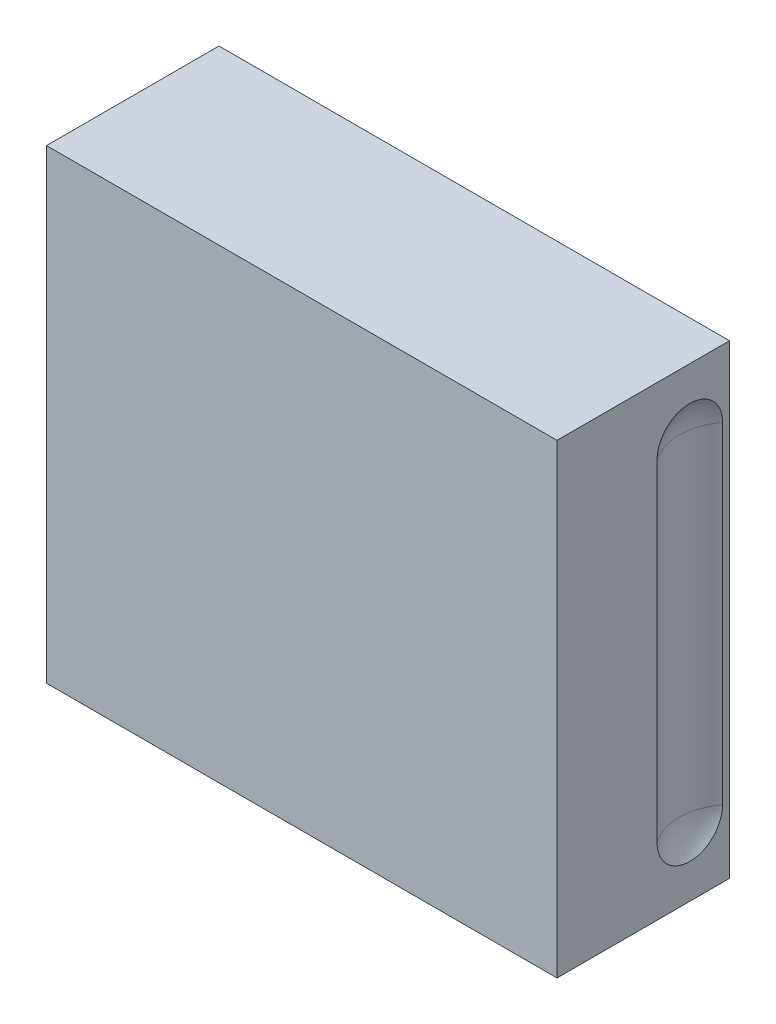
ISO-10303-21;
HEADER;
FILE_DESCRIPTION(('STEP AP214'),'2;1');
FILE_NAME('part.step','',(''),(''),'','','');
FILE_SCHEMA(('AUTOMOTIVE_DESIGN { 1 0 10303 214 1 1 1 1 }'));
ENDSEC;
DATA;
#1=APPLICATION_CONTEXT('core data for automotive mechanical design processes');
#2=APPLICATION_PROTOCOL_DEFINITION('international standard','automotive_design',2000,#1);
#3=PRODUCT_CONTEXT('',#1,'mechanical');
#4=PRODUCT('Part','Part','',(#3));
#5=PRODUCT_RELATED_PRODUCT_CATEGORY('part','',(#4));
#6=PRODUCT_DEFINITION_FORMATION('','',#4);
#7=PRODUCT_DEFINITION_CONTEXT('part definition',#1,'design');
#8=PRODUCT_DEFINITION('design','',#6,#7);
#9=PRODUCT_DEFINITION_SHAPE('','',#8);
#10=(LENGTH_UNIT() NAMED_UNIT(*) SI_UNIT(.MILLI.,.METRE.));
#11=(NAMED_UNIT(*) PLANE_ANGLE_UNIT() SI_UNIT($,.RADIAN.));
#12=(NAMED_UNIT(*) SI_UNIT($,.STERADIAN.) SOLID_ANGLE_UNIT());
#13=UNCERTAINTY_MEASURE_WITH_UNIT(LENGTH_MEASURE(1.E-05),#10,'distance_accuracy_value','');
#14=(GEOMETRIC_REPRESENTATION_CONTEXT(3) GLOBAL_UNCERTAINTY_ASSIGNED_CONTEXT((#13)) GLOBAL_UNIT_ASSIGNED_CONTEXT((#10,
#11,#12)) REPRESENTATION_CONTEXT('',''));
#15=CARTESIAN_POINT('',(0.,0.,0.));
#16=DIRECTION('',(0.,0.,1.));
#17=DIRECTION('',(1.,0.,0.));
#18=AXIS2_PLACEMENT_3D('',#15,#16,#17);
#19=CARTESIAN_POINT('',(-112.98541197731,-126.800411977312,83.));
#20=DIRECTION('',(0.,0.,-1.));
#21=DIRECTION('',(-1.,0.,0.));
#22=AXIS2_PLACEMENT_3D('',#19,#20,#21);
#23=TOROIDAL_SURFACE('',#22,8.99999999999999,2.5);
#24=CARTESIAN_POINT('',(-101.50041197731,-126.800411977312,83.2734501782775));
#25=CARTESIAN_POINT('',(-101.50041197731,-126.853209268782,83.2734552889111));
#26=CARTESIAN_POINT('',(-101.50041197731,-126.9060333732,83.2701925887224));
#27=CARTESIAN_POINT('',(-101.50041197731,-126.984474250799,83.2600004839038));
#28=CARTESIAN_POINT('',(-101.50041197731,-127.010455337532,83.25572910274));
#29=CARTESIAN_POINT('',(-101.50041197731,-127.062039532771,83.2452152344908));
#30=CARTESIAN_POINT('',(-101.50041197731,-127.087642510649,83.2389720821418));
#31=CARTESIAN_POINT('',(-101.50041197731,-127.132750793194,83.2257832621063));
#32=CARTESIAN_POINT('',(-101.50041197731,-127.152384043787,83.2192769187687));
#33=CARTESIAN_POINT('',(-101.50041197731,-127.19101163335,83.2046080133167));
#34=CARTESIAN_POINT('',(-101.50041197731,-127.210006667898,83.1964473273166));
#35=CARTESIAN_POINT('',(-101.50041197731,-127.247221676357,83.1779977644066));
#36=CARTESIAN_POINT('',(-101.50041197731,-127.265430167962,83.1676854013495));
#37=CARTESIAN_POINT('',(-101.50041197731,-127.300082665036,83.144436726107));
#38=CARTESIAN_POINT('',(-101.50041197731,-127.316534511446,83.1315128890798));
#39=CARTESIAN_POINT('',(-101.50041197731,-127.337990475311,83.1103383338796));
#40=CARTESIAN_POINT('',(-101.50041197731,-127.344312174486,83.1034297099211));
#41=CARTESIAN_POINT('',(-101.50041197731,-127.356043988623,83.0888561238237));
#42=CARTESIAN_POINT('',(-101.50041197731,-127.361453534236,83.081190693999));
#43=CARTESIAN_POINT('',(-101.50041197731,-127.371087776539,83.0649921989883));
#44=CARTESIAN_POINT('',(-101.50041197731,-127.375295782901,83.0564489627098));
#45=CARTESIAN_POINT('',(-101.50041197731,-127.381999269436,83.038730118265));
#46=CARTESIAN_POINT('',(-101.50041197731,-127.384501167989,83.0295570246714));
#47=CARTESIAN_POINT('',(-101.50041197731,-127.387317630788,83.0118191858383));
#48=CARTESIAN_POINT('',(-101.50041197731,-127.387826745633,83.0032859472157));
#49=CARTESIAN_POINT('',(-101.50041197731,-127.387135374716,82.9862928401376));
#50=CARTESIAN_POINT('',(-101.50041197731,-127.385934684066,82.9778329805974));
#51=CARTESIAN_POINT('',(-101.50041197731,-127.380556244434,82.9554528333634));
#52=CARTESIAN_POINT('',(-101.50041197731,-127.37487608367,82.9418895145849));
#53=CARTESIAN_POINT('',(-101.50041197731,-127.361755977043,82.918977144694));
#54=CARTESIAN_POINT('',(-101.50041197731,-127.354825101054,82.9093104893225));
#55=CARTESIAN_POINT('',(-101.50041197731,-127.339557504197,82.8911398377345));
#56=CARTESIAN_POINT('',(-101.50041197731,-127.331217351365,82.8826387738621));
#57=CARTESIAN_POINT('',(-101.50041197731,-127.306909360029,82.8606392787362));
#58=CARTESIAN_POINT('',(-101.50041197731,-127.28995691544,82.8482454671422));
#59=CARTESIAN_POINT('',(-101.50041197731,-127.254503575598,82.8259633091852));
#60=CARTESIAN_POINT('',(-101.50041197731,-127.235999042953,82.8160810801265));
#61=CARTESIAN_POINT('',(-101.50041197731,-127.197935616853,82.798243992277));
#62=CARTESIAN_POINT('',(-101.50041197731,-127.178370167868,82.7903033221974));
#63=CARTESIAN_POINT('',(-101.50041197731,-127.13864292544,82.7760830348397));
#64=CARTESIAN_POINT('',(-101.50041197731,-127.118480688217,82.7698046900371));
#65=CARTESIAN_POINT('',(-101.50041197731,-127.057321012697,82.7530655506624));
#66=CARTESIAN_POINT('',(-101.50041197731,-127.015733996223,82.7447364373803));
#67=CARTESIAN_POINT('',(-101.50041197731,-126.939606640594,82.7338085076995));
#68=CARTESIAN_POINT('',(-101.50041197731,-126.905165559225,82.7304412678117));
#69=CARTESIAN_POINT('',(-101.50041197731,-126.836090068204,82.7265736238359));
#70=CARTESIAN_POINT('',(-101.50041197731,-126.801455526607,82.7260755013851));
#71=CARTESIAN_POINT('',(-101.50041197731,-126.732300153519,82.7279146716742));
#72=CARTESIAN_POINT('',(-101.50041197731,-126.697779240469,82.7302489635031));
#73=CARTESIAN_POINT('',(-101.50041197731,-126.629088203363,82.737906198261));
#74=CARTESIAN_POINT('',(-101.50041197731,-126.594917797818,82.7432265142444));
#75=CARTESIAN_POINT('',(-101.50041197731,-126.528454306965,82.7570160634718));
#76=CARTESIAN_POINT('',(-101.500411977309,-126.496137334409,82.7653688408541));
#77=CARTESIAN_POINT('',(-101.500411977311,-126.432789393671,82.7859159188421));
#78=CARTESIAN_POINT('',(-101.500411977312,-126.401754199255,82.7980962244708));
#79=CARTESIAN_POINT('',(-101.500411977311,-126.357748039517,82.8199636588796));
#80=CARTESIAN_POINT('',(-101.50041197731,-126.343785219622,82.8276467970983));
#81=CARTESIAN_POINT('',(-101.50041197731,-126.316769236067,82.844456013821));
#82=CARTESIAN_POINT('',(-101.50041197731,-126.303714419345,82.8535793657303));
#83=CARTESIAN_POINT('',(-101.50041197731,-126.281273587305,82.8717689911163));
#84=CARTESIAN_POINT('',(-101.50041197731,-126.271653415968,82.8805400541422));
#85=CARTESIAN_POINT('',(-101.50041197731,-126.253864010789,82.8994148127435));
#86=CARTESIAN_POINT('',(-101.50041197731,-126.245690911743,82.9095148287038));
#87=CARTESIAN_POINT('',(-101.50041197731,-126.229534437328,82.9343470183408));
#88=CARTESIAN_POINT('',(-101.50041197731,-126.22224800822,82.9495836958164));
#89=CARTESIAN_POINT('',(-101.50041197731,-126.215681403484,82.9737193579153));
#90=CARTESIAN_POINT('',(-101.50041197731,-126.214224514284,82.9820332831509));
#91=CARTESIAN_POINT('',(-101.50041197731,-126.212969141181,82.9987883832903));
#92=CARTESIAN_POINT('',(-101.50041197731,-126.213169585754,83.0072294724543));
#93=CARTESIAN_POINT('',(-101.50041197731,-126.215071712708,83.0228241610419));
#94=CARTESIAN_POINT('',(-101.50041197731,-126.216576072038,83.0300031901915));
#95=CARTESIAN_POINT('',(-101.50041197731,-126.220686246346,83.0440462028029));
#96=CARTESIAN_POINT('',(-101.50041197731,-126.223294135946,83.0509095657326));
#97=CARTESIAN_POINT('',(-101.50041197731,-126.235145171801,83.076596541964));
#98=CARTESIAN_POINT('',(-101.50041197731,-126.247700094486,83.0938883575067));
#99=CARTESIAN_POINT('',(-101.50041197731,-126.274070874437,83.1221499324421));
#100=CARTESIAN_POINT('',(-101.50041197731,-126.287350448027,83.1336903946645));
#101=CARTESIAN_POINT('',(-101.50041197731,-126.315456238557,83.1547882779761));
#102=CARTESIAN_POINT('',(-101.50041197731,-126.330286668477,83.1643400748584));
#103=CARTESIAN_POINT('',(-101.50041197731,-126.360667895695,83.1816683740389));
#104=CARTESIAN_POINT('',(-101.50041197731,-126.376206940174,83.1894661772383));
#105=CARTESIAN_POINT('',(-101.50041197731,-126.407888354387,83.2037344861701));
#106=CARTESIAN_POINT('',(-101.50041197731,-126.424031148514,83.2102040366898));
#107=CARTESIAN_POINT('',(-101.50041197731,-126.47309372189,83.2279283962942));
#108=CARTESIAN_POINT('',(-101.50041197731,-126.506624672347,83.2374868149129));
#109=CARTESIAN_POINT('',(-101.50041197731,-126.583084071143,83.2550274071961));
#110=CARTESIAN_POINT('',(-101.50041197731,-126.626236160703,83.2619925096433));
#111=CARTESIAN_POINT('',(-101.50041197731,-126.713056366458,83.2712043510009));
#112=CARTESIAN_POINT('',(-101.50041197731,-126.756724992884,83.2734459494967));
#113=CARTESIAN_POINT('',(-101.50041197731,-126.800411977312,83.2734501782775));
#114=B_SPLINE_CURVE_WITH_KNOTS('',3,(#24,#25,#26,#27,#28,#29,#30,#31,#32,#33,#34,#35,#36,#37,
#38,#39,#40,#41,#42,#43,#44,#45,#46,#47,#48,#49,#50,#51,#52,#53,#54,#55,#56,#57,#58,#59,#60,#61,
#62,#63,#64,#65,#66,#67,#68,#69,#70,#71,#72,#73,#74,#75,#76,#77,#78,#79,#80,#81,#82,#83,#84,#85,
#86,#87,#88,#89,#90,#91,#92,#93,#94,#95,#96,#97,#98,#99,#100,#101,#102,#103,#104,#105,#106,#107,
#108,#109,#110,#111,#112,#113),.UNSPECIFIED.,.T.,.F.,(4,2,2,2,2,2,2,2,2,2,2,2,2,2,2,2,2,2,2,2,2,
2,2,2,2,2,2,2,2,2,2,2,2,2,2,2,2,2,2,2,2,2,2,2,4),(0.,0.158280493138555,0.237215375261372,
0.316176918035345,0.378168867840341,0.440090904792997,0.502727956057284,0.565072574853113,
0.593109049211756,0.621162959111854,0.649589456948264,0.677908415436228,0.703381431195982,
0.728857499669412,0.772301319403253,0.807831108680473,0.84344870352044,0.906101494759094,
0.968905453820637,1.0321555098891,1.09545384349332,1.22232014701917,1.32603071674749,
1.42982374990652,1.53350691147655,1.63709900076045,1.73707341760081,1.83668645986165,
1.88443333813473,1.93209088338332,1.97102529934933,2.00985409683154,2.05957979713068,
2.0847548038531,2.10991353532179,2.13182148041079,2.15377079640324,2.21659974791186,
2.26922071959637,2.32198854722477,2.37407604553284,2.42620087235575,2.5305277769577,
2.66135426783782,2.79232305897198),.UNSPECIFIED.);
#115=CARTESIAN_POINT('',(-101.50041197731,-126.800411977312,83.2734501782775));
#116=VERTEX_POINT('',#115);
#117=EDGE_CURVE('E18',#116,#116,#114,.T.);
#118=ORIENTED_EDGE('',*,*,#117,.F.);
#119=EDGE_LOOP('',(#118));
#120=FACE_BOUND('',#119,.T.);
#121=ADVANCED_FACE('F14',(#120),#23,.F.);
#122=CARTESIAN_POINT('',(-112.98541197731,-185.800411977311,83.));
#123=DIRECTION('',(0.,0.,-1.));
#124=DIRECTION('',(-1.,0.,0.));
#125=AXIS2_PLACEMENT_3D('',#122,#123,#124);
#126=TOROIDAL_SURFACE('',#125,8.99999999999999,2.5);
#127=CARTESIAN_POINT('',(-101.50041197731,-185.800411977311,83.2734501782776));
#128=CARTESIAN_POINT('',(-101.50041197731,-185.853209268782,83.2734552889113));
#129=CARTESIAN_POINT('',(-101.50041197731,-185.9060333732,83.2701925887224));
#130=CARTESIAN_POINT('',(-101.50041197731,-185.984474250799,83.2600004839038));
#131=CARTESIAN_POINT('',(-101.50041197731,-186.010455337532,83.25572910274));
#132=CARTESIAN_POINT('',(-101.50041197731,-186.062039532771,83.2452152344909));
#133=CARTESIAN_POINT('',(-101.50041197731,-186.087642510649,83.2389720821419));
#134=CARTESIAN_POINT('',(-101.50041197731,-186.132750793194,83.2257832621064));
#135=CARTESIAN_POINT('',(-101.50041197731,-186.152384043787,83.2192769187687));
#136=CARTESIAN_POINT('',(-101.50041197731,-186.191011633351,83.2046080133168));
#137=CARTESIAN_POINT('',(-101.50041197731,-186.210006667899,83.1964473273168));
#138=CARTESIAN_POINT('',(-101.50041197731,-186.247221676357,83.1779977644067));
#139=CARTESIAN_POINT('',(-101.50041197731,-186.265430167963,83.1676854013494));
#140=CARTESIAN_POINT('',(-101.50041197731,-186.300082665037,83.1444367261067));
#141=CARTESIAN_POINT('',(-101.50041197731,-186.316534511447,83.1315128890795));
#142=CARTESIAN_POINT('',(-101.50041197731,-186.337990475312,83.1103383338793));
#143=CARTESIAN_POINT('',(-101.50041197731,-186.344312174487,83.1034297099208));
#144=CARTESIAN_POINT('',(-101.50041197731,-186.356043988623,83.0888561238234));
#145=CARTESIAN_POINT('',(-101.50041197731,-186.361453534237,83.0811906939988));
#146=CARTESIAN_POINT('',(-101.50041197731,-186.37108777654,83.0649921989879));
#147=CARTESIAN_POINT('',(-101.50041197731,-186.3752957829,83.0564489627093));
#148=CARTESIAN_POINT('',(-101.50041197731,-186.381999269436,83.0387301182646));
#149=CARTESIAN_POINT('',(-101.50041197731,-186.384501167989,83.0295570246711));
#150=CARTESIAN_POINT('',(-101.50041197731,-186.387317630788,83.0118191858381));
#151=CARTESIAN_POINT('',(-101.50041197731,-186.387826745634,83.0032859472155));
#152=CARTESIAN_POINT('',(-101.50041197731,-186.387135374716,82.9862928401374));
#153=CARTESIAN_POINT('',(-101.50041197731,-186.385934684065,82.9778329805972));
#154=CARTESIAN_POINT('',(-101.50041197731,-186.380556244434,82.9554528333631));
#155=CARTESIAN_POINT('',(-101.50041197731,-186.374876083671,82.9418895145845));
#156=CARTESIAN_POINT('',(-101.50041197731,-186.361755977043,82.9189771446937));
#157=CARTESIAN_POINT('',(-101.50041197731,-186.354825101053,82.9093104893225));
#158=CARTESIAN_POINT('',(-101.50041197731,-186.339557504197,82.8911398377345));
#159=CARTESIAN_POINT('',(-101.50041197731,-186.331217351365,82.8826387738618));
#160=CARTESIAN_POINT('',(-101.50041197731,-186.30690936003,82.8606392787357));
#161=CARTESIAN_POINT('',(-101.50041197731,-186.28995691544,82.8482454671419));
#162=CARTESIAN_POINT('',(-101.50041197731,-186.254503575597,82.825963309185));
#163=CARTESIAN_POINT('',(-101.50041197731,-186.235999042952,82.8160810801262));
#164=CARTESIAN_POINT('',(-101.50041197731,-186.197935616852,82.7982439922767));
#165=CARTESIAN_POINT('',(-101.50041197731,-186.178370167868,82.7903033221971));
#166=CARTESIAN_POINT('',(-101.50041197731,-186.13864292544,82.7760830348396));
#167=CARTESIAN_POINT('',(-101.50041197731,-186.118480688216,82.769804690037));
#168=CARTESIAN_POINT('',(-101.50041197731,-186.057321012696,82.7530655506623));
#169=CARTESIAN_POINT('',(-101.50041197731,-186.015733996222,82.7447364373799));
#170=CARTESIAN_POINT('',(-101.50041197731,-185.939606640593,82.7338085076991));
#171=CARTESIAN_POINT('',(-101.50041197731,-185.905165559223,82.7304412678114));
#172=CARTESIAN_POINT('',(-101.50041197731,-185.836090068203,82.7265736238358));
#173=CARTESIAN_POINT('',(-101.50041197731,-185.801455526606,82.7260755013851));
#174=CARTESIAN_POINT('',(-101.50041197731,-185.732300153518,82.7279146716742));
#175=CARTESIAN_POINT('',(-101.50041197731,-185.697779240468,82.7302489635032));
#176=CARTESIAN_POINT('',(-101.50041197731,-185.629088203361,82.7379061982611));
#177=CARTESIAN_POINT('',(-101.50041197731,-185.594917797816,82.7432265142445));
#178=CARTESIAN_POINT('',(-101.50041197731,-185.528454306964,82.757016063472));
#179=CARTESIAN_POINT('',(-101.500411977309,-185.496137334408,82.7653688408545));
#180=CARTESIAN_POINT('',(-101.500411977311,-185.43278939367,82.7859159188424));
#181=CARTESIAN_POINT('',(-101.500411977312,-185.401754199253,82.7980962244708));
#182=CARTESIAN_POINT('',(-101.500411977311,-185.357748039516,82.81996365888));
#183=CARTESIAN_POINT('',(-101.50041197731,-185.343785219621,82.8276467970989));
#184=CARTESIAN_POINT('',(-101.50041197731,-185.316769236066,82.8444560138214));
#185=CARTESIAN_POINT('',(-101.50041197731,-185.303714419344,82.8535793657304));
#186=CARTESIAN_POINT('',(-101.50041197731,-185.281273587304,82.8717689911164));
#187=CARTESIAN_POINT('',(-101.50041197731,-185.271653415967,82.8805400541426));
#188=CARTESIAN_POINT('',(-101.50041197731,-185.253864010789,82.899414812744));
#189=CARTESIAN_POINT('',(-101.50041197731,-185.245690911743,82.9095148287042));
#190=CARTESIAN_POINT('',(-101.50041197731,-185.229534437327,82.9343470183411));
#191=CARTESIAN_POINT('',(-101.50041197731,-185.222248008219,82.9495836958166));
#192=CARTESIAN_POINT('',(-101.50041197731,-185.215681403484,82.9737193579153));
#193=CARTESIAN_POINT('',(-101.50041197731,-185.214224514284,82.982033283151));
#194=CARTESIAN_POINT('',(-101.50041197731,-185.212969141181,82.9987883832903));
#195=CARTESIAN_POINT('',(-101.50041197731,-185.213169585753,83.0072294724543));
#196=CARTESIAN_POINT('',(-101.50041197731,-185.215071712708,83.0228241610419));
#197=CARTESIAN_POINT('',(-101.50041197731,-185.216576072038,83.0300031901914));
#198=CARTESIAN_POINT('',(-101.50041197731,-185.220686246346,83.0440462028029));
#199=CARTESIAN_POINT('',(-101.50041197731,-185.223294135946,83.0509095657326));
#200=CARTESIAN_POINT('',(-101.50041197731,-185.2351451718,83.0765965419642));
#201=CARTESIAN_POINT('',(-101.50041197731,-185.247700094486,83.0938883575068));
#202=CARTESIAN_POINT('',(-101.50041197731,-185.274070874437,83.1221499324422));
#203=CARTESIAN_POINT('',(-101.50041197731,-185.287350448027,83.1336903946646));
#204=CARTESIAN_POINT('',(-101.50041197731,-185.315456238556,83.1547882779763));
#205=CARTESIAN_POINT('',(-101.50041197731,-185.330286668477,83.1643400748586));
#206=CARTESIAN_POINT('',(-101.50041197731,-185.360667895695,83.181668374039));
#207=CARTESIAN_POINT('',(-101.50041197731,-185.376206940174,83.1894661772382));
#208=CARTESIAN_POINT('',(-101.50041197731,-185.407888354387,83.20373448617));
#209=CARTESIAN_POINT('',(-101.50041197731,-185.424031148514,83.2102040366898));
#210=CARTESIAN_POINT('',(-101.50041197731,-185.47309372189,83.2279283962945));
#211=CARTESIAN_POINT('',(-101.50041197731,-185.506624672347,83.2374868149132));
#212=CARTESIAN_POINT('',(-101.50041197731,-185.583084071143,83.2550274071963));
#213=CARTESIAN_POINT('',(-101.50041197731,-185.626236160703,83.2619925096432));
#214=CARTESIAN_POINT('',(-101.50041197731,-185.713056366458,83.2712043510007));
#215=CARTESIAN_POINT('',(-101.50041197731,-185.756724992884,83.2734459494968));
#216=CARTESIAN_POINT('',(-101.50041197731,-185.800411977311,83.2734501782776));
#217=B_SPLINE_CURVE_WITH_KNOTS('',3,(#127,#128,#129,#130,#131,#132,#133,#134,#135,#136,#137,
#138,#139,#140,#141,#142,#143,#144,#145,#146,#147,#148,#149,#150,#151,#152,#153,#154,#155,#156,
#157,#158,#159,#160,#161,#162,#163,#164,#165,#166,#167,#168,#169,#170,#171,#172,#173,#174,#175,
#176,#177,#178,#179,#180,#181,#182,#183,#184,#185,#186,#187,#188,#189,#190,#191,#192,#193,#194,
#195,#196,#197,#198,#199,#200,#201,#202,#203,#204,#205,#206,#207,#208,#209,#210,#211,#212,#213,
#214,#215,#216),.UNSPECIFIED.,.T.,.F.,(4,2,2,2,2,2,2,2,2,2,2,2,2,2,2,2,2,2,2,2,2,2,2,2,2,2,2,2,
2,2,2,2,2,2,2,2,2,2,2,2,2,2,2,2,4),(0.,0.158280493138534,0.237215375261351,0.316176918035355,
0.378168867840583,0.440090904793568,0.502727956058,0.565072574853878,0.593109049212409,
0.621162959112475,0.649589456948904,0.677908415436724,0.703381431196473,0.728857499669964,
0.772301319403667,0.807831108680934,0.843448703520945,0.90610149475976,0.968905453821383,
1.03215550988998,1.09545384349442,1.22232014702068,1.32603071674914,1.42982374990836,
1.53350691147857,1.63709900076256,1.73707341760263,1.83668645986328,1.8844333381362,
1.93209088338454,1.97102529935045,2.00985409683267,2.05957979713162,2.08475480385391,
2.10991353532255,2.13182148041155,2.15377079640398,2.21659974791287,2.2692207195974,
2.32198854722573,2.37407604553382,2.42620087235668,2.53052777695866,2.66135426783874,
2.79232305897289),.UNSPECIFIED.);
#218=CARTESIAN_POINT('',(-101.50041197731,-185.800411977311,83.2734501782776));
#219=VERTEX_POINT('',#218);
#220=EDGE_CURVE('E474',#219,#219,#217,.T.);
#221=ORIENTED_EDGE('',*,*,#220,.F.);
#222=EDGE_LOOP('',(#221));
#223=FACE_BOUND('',#222,.T.);
#224=ADVANCED_FACE('F438',(#223),#126,.F.);
#225=CARTESIAN_POINT('',(-136.01541197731,-126.800411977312,83.));
#226=DIRECTION('',(0.,0.,-1.));
#227=DIRECTION('',(-1.,0.,0.));
#228=AXIS2_PLACEMENT_3D('',#225,#226,#227);
#229=TOROIDAL_SURFACE('',#228,9.00000000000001,2.5);
#230=CARTESIAN_POINT('',(-147.50041197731,-126.800411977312,83.2734501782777));
#231=CARTESIAN_POINT('',(-147.50041197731,-126.747614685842,83.2734552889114));
#232=CARTESIAN_POINT('',(-147.50041197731,-126.694790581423,83.2701925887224));
#233=CARTESIAN_POINT('',(-147.50041197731,-126.616349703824,83.2600004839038));
#234=CARTESIAN_POINT('',(-147.50041197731,-126.590368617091,83.2557291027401));
#235=CARTESIAN_POINT('',(-147.50041197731,-126.538784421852,83.2452152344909));
#236=CARTESIAN_POINT('',(-147.50041197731,-126.513181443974,83.2389720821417));
#237=CARTESIAN_POINT('',(-147.50041197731,-126.468073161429,83.2257832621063));
#238=CARTESIAN_POINT('',(-147.50041197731,-126.448439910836,83.2192769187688));
#239=CARTESIAN_POINT('',(-147.50041197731,-126.409812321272,83.204608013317));
#240=CARTESIAN_POINT('',(-147.50041197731,-126.390817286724,83.1964473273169));
#241=CARTESIAN_POINT('',(-147.50041197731,-126.353602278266,83.1779977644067));
#242=CARTESIAN_POINT('',(-147.50041197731,-126.33539378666,83.1676854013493));
#243=CARTESIAN_POINT('',(-147.50041197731,-126.300741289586,83.1444367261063));
#244=CARTESIAN_POINT('',(-147.500411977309,-126.284289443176,83.131512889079));
#245=CARTESIAN_POINT('',(-147.50041197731,-126.262833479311,83.1103383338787));
#246=CARTESIAN_POINT('',(-147.50041197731,-126.256511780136,83.1034297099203));
#247=CARTESIAN_POINT('',(-147.50041197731,-126.244779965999,83.0888561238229));
#248=CARTESIAN_POINT('',(-147.50041197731,-126.239370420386,83.0811906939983));
#249=CARTESIAN_POINT('',(-147.50041197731,-126.229736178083,83.0649921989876));
#250=CARTESIAN_POINT('',(-147.50041197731,-126.225528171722,83.056448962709));
#251=CARTESIAN_POINT('',(-147.50041197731,-126.218824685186,83.0387301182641));
#252=CARTESIAN_POINT('',(-147.50041197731,-126.216322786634,83.0295570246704));
#253=CARTESIAN_POINT('',(-147.50041197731,-126.213506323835,83.0118191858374));
#254=CARTESIAN_POINT('',(-147.50041197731,-126.21299720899,83.0032859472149));
#255=CARTESIAN_POINT('',(-147.50041197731,-126.213688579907,82.986292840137));
#256=CARTESIAN_POINT('',(-147.50041197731,-126.214889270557,82.9778329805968));
#257=CARTESIAN_POINT('',(-147.50041197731,-126.220267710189,82.9554528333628));
#258=CARTESIAN_POINT('',(-147.50041197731,-126.225947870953,82.9418895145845));
#259=CARTESIAN_POINT('',(-147.50041197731,-126.239067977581,82.9189771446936));
#260=CARTESIAN_POINT('',(-147.50041197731,-126.24599885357,82.9093104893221));
#261=CARTESIAN_POINT('',(-147.50041197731,-126.261266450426,82.8911398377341));
#262=CARTESIAN_POINT('',(-147.50041197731,-126.269606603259,82.8826387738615));
#263=CARTESIAN_POINT('',(-147.50041197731,-126.293914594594,82.8606392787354));
#264=CARTESIAN_POINT('',(-147.50041197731,-126.310867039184,82.8482454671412));
#265=CARTESIAN_POINT('',(-147.50041197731,-126.346320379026,82.8259633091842));
#266=CARTESIAN_POINT('',(-147.50041197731,-126.364824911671,82.8160810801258));
#267=CARTESIAN_POINT('',(-147.50041197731,-126.402888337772,82.7982439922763));
#268=CARTESIAN_POINT('',(-147.50041197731,-126.422453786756,82.7903033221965));
#269=CARTESIAN_POINT('',(-147.50041197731,-126.462181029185,82.7760830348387));
#270=CARTESIAN_POINT('',(-147.50041197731,-126.482343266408,82.7698046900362));
#271=CARTESIAN_POINT('',(-147.50041197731,-126.543502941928,82.7530655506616));
#272=CARTESIAN_POINT('',(-147.50041197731,-126.585089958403,82.7447364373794));
#273=CARTESIAN_POINT('',(-147.50041197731,-126.661217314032,82.7338085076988));
#274=CARTESIAN_POINT('',(-147.50041197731,-126.695658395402,82.7304412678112));
#275=CARTESIAN_POINT('',(-147.50041197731,-126.764733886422,82.7265736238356));
#276=CARTESIAN_POINT('',(-147.50041197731,-126.799368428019,82.7260755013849));
#277=CARTESIAN_POINT('',(-147.50041197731,-126.868523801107,82.7279146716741));
#278=CARTESIAN_POINT('',(-147.50041197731,-126.903044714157,82.7302489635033));
#279=CARTESIAN_POINT('',(-147.50041197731,-126.971735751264,82.7379061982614));
#280=CARTESIAN_POINT('',(-147.50041197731,-127.005906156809,82.7432265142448));
#281=CARTESIAN_POINT('',(-147.50041197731,-127.072369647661,82.7570160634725));
#282=CARTESIAN_POINT('',(-147.500411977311,-127.104686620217,82.7653688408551));
#283=CARTESIAN_POINT('',(-147.500411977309,-127.168034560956,82.7859159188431));
#284=CARTESIAN_POINT('',(-147.500411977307,-127.199069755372,82.7980962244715));
#285=CARTESIAN_POINT('',(-147.500411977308,-127.243075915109,82.8199636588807));
#286=CARTESIAN_POINT('',(-147.50041197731,-127.257038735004,82.8276467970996));
#287=CARTESIAN_POINT('',(-147.50041197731,-127.284054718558,82.8444560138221));
#288=CARTESIAN_POINT('',(-147.50041197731,-127.29710953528,82.8535793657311));
#289=CARTESIAN_POINT('',(-147.50041197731,-127.31955036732,82.8717689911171));
#290=CARTESIAN_POINT('',(-147.50041197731,-127.329170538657,82.8805400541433));
#291=CARTESIAN_POINT('',(-147.50041197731,-127.346959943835,82.8994148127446));
#292=CARTESIAN_POINT('',(-147.50041197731,-127.355133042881,82.9095148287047));
#293=CARTESIAN_POINT('',(-147.50041197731,-127.371289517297,82.9343470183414));
#294=CARTESIAN_POINT('',(-147.50041197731,-127.378575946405,82.9495836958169));
#295=CARTESIAN_POINT('',(-147.50041197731,-127.38514255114,82.9737193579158));
#296=CARTESIAN_POINT('',(-147.50041197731,-127.38659944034,82.9820332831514));
#297=CARTESIAN_POINT('',(-147.50041197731,-127.387854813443,82.9987883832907));
#298=CARTESIAN_POINT('',(-147.50041197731,-127.387654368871,83.0072294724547));
#299=CARTESIAN_POINT('',(-147.50041197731,-127.385752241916,83.0228241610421));
#300=CARTESIAN_POINT('',(-147.50041197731,-127.384247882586,83.0300031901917));
#301=CARTESIAN_POINT('',(-147.50041197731,-127.380137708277,83.0440462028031));
#302=CARTESIAN_POINT('',(-147.50041197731,-127.377529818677,83.0509095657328));
#303=CARTESIAN_POINT('',(-147.50041197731,-127.365678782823,83.0765965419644));
#304=CARTESIAN_POINT('',(-147.50041197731,-127.353123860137,83.0938883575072));
#305=CARTESIAN_POINT('',(-147.50041197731,-127.326753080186,83.1221499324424));
#306=CARTESIAN_POINT('',(-147.50041197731,-127.313473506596,83.1336903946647));
#307=CARTESIAN_POINT('',(-147.50041197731,-127.285367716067,83.1547882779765));
#308=CARTESIAN_POINT('',(-147.50041197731,-127.270537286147,83.1643400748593));
#309=CARTESIAN_POINT('',(-147.50041197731,-127.240156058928,83.1816683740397));
#310=CARTESIAN_POINT('',(-147.50041197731,-127.224617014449,83.1894661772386));
#311=CARTESIAN_POINT('',(-147.50041197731,-127.192935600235,83.2037344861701));
#312=CARTESIAN_POINT('',(-147.50041197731,-127.176792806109,83.21020403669));
#313=CARTESIAN_POINT('',(-147.50041197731,-127.127730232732,83.227928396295));
#314=CARTESIAN_POINT('',(-147.50041197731,-127.094199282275,83.2374868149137));
#315=CARTESIAN_POINT('',(-147.50041197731,-127.017739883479,83.2550274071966));
#316=CARTESIAN_POINT('',(-147.50041197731,-126.974587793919,83.2619925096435));
#317=CARTESIAN_POINT('',(-147.50041197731,-126.887767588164,83.2712043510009));
#318=CARTESIAN_POINT('',(-147.50041197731,-126.844098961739,83.2734459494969));
#319=CARTESIAN_POINT('',(-147.50041197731,-126.800411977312,83.2734501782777));
#320=B_SPLINE_CURVE_WITH_KNOTS('',3,(#230,#231,#232,#233,#234,#235,#236,#237,#238,#239,#240,
#241,#242,#243,#244,#245,#246,#247,#248,#249,#250,#251,#252,#253,#254,#255,#256,#257,#258,#259,
#260,#261,#262,#263,#264,#265,#266,#267,#268,#269,#270,#271,#272,#273,#274,#275,#276,#277,#278,
#279,#280,#281,#282,#283,#284,#285,#286,#287,#288,#289,#290,#291,#292,#293,#294,#295,#296,#297,
#298,#299,#300,#301,#302,#303,#304,#305,#306,#307,#308,#309,#310,#311,#312,#313,#314,#315,#316,
#317,#318,#319),.UNSPECIFIED.,.T.,.F.,(4,2,2,2,2,2,2,2,2,2,2,2,2,2,2,2,2,2,2,2,2,2,2,2,2,2,2,2,
2,2,2,2,2,2,2,2,2,2,2,2,2,2,2,2,4),(0.,0.158280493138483,0.237215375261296,0.316176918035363,
0.378168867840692,0.440090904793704,0.502727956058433,0.565072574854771,0.593109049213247,
0.621162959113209,0.649589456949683,0.677908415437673,0.703381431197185,0.728857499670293,
0.772301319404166,0.807831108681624,0.843448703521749,0.906101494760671,0.968905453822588,
1.03215550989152,1.09545384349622,1.22232014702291,1.32603071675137,1.42982374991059,
1.53350691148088,1.63709900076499,1.7370734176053,1.83668645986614,1.88443333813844,
1.93209088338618,1.97102529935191,2.00985409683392,2.05957979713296,2.0847548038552,
2.10991353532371,2.1318214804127,2.15377079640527,2.21659974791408,2.26922071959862,
2.32198854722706,2.37407604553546,2.42620087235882,2.53052777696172,2.66135426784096,
2.79232305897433),.UNSPECIFIED.);
#321=CARTESIAN_POINT('',(-147.50041197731,-126.800411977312,83.2734501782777));
#322=VERTEX_POINT('',#321);
#323=EDGE_CURVE('E269',#322,#322,#320,.T.);
#324=ORIENTED_EDGE('',*,*,#323,.F.);
#325=EDGE_LOOP('',(#324));
#326=FACE_BOUND('',#325,.T.);
#327=ADVANCED_FACE('F430',(#326),#229,.F.);
#328=CARTESIAN_POINT('',(-136.01541197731,-185.800411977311,83.));
#329=DIRECTION('',(0.,0.,-1.));
#330=DIRECTION('',(-1.,0.,0.));
#331=AXIS2_PLACEMENT_3D('',#328,#329,#330);
#332=TOROIDAL_SURFACE('',#331,9.00000000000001,2.5);
#333=CARTESIAN_POINT('',(-147.50041197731,-185.800411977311,83.2734501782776));
#334=CARTESIAN_POINT('',(-147.50041197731,-185.747614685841,83.2734552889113));
#335=CARTESIAN_POINT('',(-147.50041197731,-185.694790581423,83.2701925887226));
#336=CARTESIAN_POINT('',(-147.50041197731,-185.616349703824,83.2600004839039));
#337=CARTESIAN_POINT('',(-147.50041197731,-185.590368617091,83.25572910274));
#338=CARTESIAN_POINT('',(-147.50041197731,-185.538784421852,83.2452152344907));
#339=CARTESIAN_POINT('',(-147.50041197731,-185.513181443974,83.2389720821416));
#340=CARTESIAN_POINT('',(-147.50041197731,-185.468073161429,83.2257832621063));
#341=CARTESIAN_POINT('',(-147.50041197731,-185.448439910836,83.2192769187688));
#342=CARTESIAN_POINT('',(-147.50041197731,-185.409812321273,83.2046080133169));
#343=CARTESIAN_POINT('',(-147.50041197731,-185.390817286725,83.1964473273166));
#344=CARTESIAN_POINT('',(-147.50041197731,-185.353602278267,83.1779977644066));
#345=CARTESIAN_POINT('',(-147.50041197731,-185.335393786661,83.1676854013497));
#346=CARTESIAN_POINT('',(-147.50041197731,-185.300741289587,83.1444367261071));
#347=CARTESIAN_POINT('',(-147.500411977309,-185.284289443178,83.1315128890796));
#348=CARTESIAN_POINT('',(-147.50041197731,-185.262833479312,83.1103383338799));
#349=CARTESIAN_POINT('',(-147.50041197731,-185.256511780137,83.1034297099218));
#350=CARTESIAN_POINT('',(-147.50041197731,-185.244779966,83.0888561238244));
#351=CARTESIAN_POINT('',(-147.50041197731,-185.239370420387,83.0811906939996));
#352=CARTESIAN_POINT('',(-147.50041197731,-185.229736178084,83.0649921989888));
#353=CARTESIAN_POINT('',(-147.50041197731,-185.225528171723,83.0564489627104));
#354=CARTESIAN_POINT('',(-147.50041197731,-185.218824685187,83.0387301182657));
#355=CARTESIAN_POINT('',(-147.50041197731,-185.216322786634,83.0295570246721));
#356=CARTESIAN_POINT('',(-147.50041197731,-185.213506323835,83.011819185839));
#357=CARTESIAN_POINT('',(-147.50041197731,-185.21299720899,83.0032859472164));
#358=CARTESIAN_POINT('',(-147.50041197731,-185.213688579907,82.9862928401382));
#359=CARTESIAN_POINT('',(-147.50041197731,-185.214889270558,82.977832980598));
#360=CARTESIAN_POINT('',(-147.50041197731,-185.22026771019,82.9554528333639));
#361=CARTESIAN_POINT('',(-147.50041197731,-185.225947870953,82.9418895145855));
#362=CARTESIAN_POINT('',(-147.50041197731,-185.23906797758,82.9189771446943));
#363=CARTESIAN_POINT('',(-147.50041197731,-185.245998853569,82.9093104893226));
#364=CARTESIAN_POINT('',(-147.50041197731,-185.261266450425,82.8911398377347));
#365=CARTESIAN_POINT('',(-147.50041197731,-185.269606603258,82.8826387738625));
#366=CARTESIAN_POINT('',(-147.50041197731,-185.293914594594,82.8606392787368));
#367=CARTESIAN_POINT('',(-147.50041197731,-185.310867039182,82.8482454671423));
#368=CARTESIAN_POINT('',(-147.50041197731,-185.346320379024,82.8259633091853));
#369=CARTESIAN_POINT('',(-147.50041197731,-185.36482491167,82.8160810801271));
#370=CARTESIAN_POINT('',(-147.50041197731,-185.40288833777,82.7982439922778));
#371=CARTESIAN_POINT('',(-147.50041197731,-185.422453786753,82.790303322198));
#372=CARTESIAN_POINT('',(-147.50041197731,-185.462181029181,82.77608303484));
#373=CARTESIAN_POINT('',(-147.50041197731,-185.482343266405,82.7698046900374));
#374=CARTESIAN_POINT('',(-147.50041197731,-185.543502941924,82.7530655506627));
#375=CARTESIAN_POINT('',(-147.50041197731,-185.585089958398,82.7447364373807));
#376=CARTESIAN_POINT('',(-147.50041197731,-185.661217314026,82.7338085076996));
#377=CARTESIAN_POINT('',(-147.50041197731,-185.695658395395,82.7304412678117));
#378=CARTESIAN_POINT('',(-147.50041197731,-185.764733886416,82.7265736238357));
#379=CARTESIAN_POINT('',(-147.50041197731,-185.799368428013,82.726075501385));
#380=CARTESIAN_POINT('',(-147.50041197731,-185.868523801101,82.7279146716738));
#381=CARTESIAN_POINT('',(-147.50041197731,-185.903044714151,82.7302489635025));
#382=CARTESIAN_POINT('',(-147.50041197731,-185.971735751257,82.7379061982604));
#383=CARTESIAN_POINT('',(-147.50041197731,-186.005906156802,82.743226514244));
#384=CARTESIAN_POINT('',(-147.50041197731,-186.072369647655,82.7570160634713));
#385=CARTESIAN_POINT('',(-147.500411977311,-186.104686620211,82.7653688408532));
#386=CARTESIAN_POINT('',(-147.500411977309,-186.16803456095,82.7859159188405));
#387=CARTESIAN_POINT('',(-147.500411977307,-186.199069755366,82.7980962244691));
#388=CARTESIAN_POINT('',(-147.500411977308,-186.243075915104,82.8199636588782));
#389=CARTESIAN_POINT('',(-147.50041197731,-186.257038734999,82.8276467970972));
#390=CARTESIAN_POINT('',(-147.50041197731,-186.284054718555,82.8444560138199));
#391=CARTESIAN_POINT('',(-147.50041197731,-186.297109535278,82.853579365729));
#392=CARTESIAN_POINT('',(-147.50041197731,-186.319550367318,82.8717689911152));
#393=CARTESIAN_POINT('',(-147.50041197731,-186.329170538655,82.8805400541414));
#394=CARTESIAN_POINT('',(-147.50041197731,-186.346959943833,82.8994148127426));
#395=CARTESIAN_POINT('',(-147.50041197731,-186.355133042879,82.9095148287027));
#396=CARTESIAN_POINT('',(-147.50041197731,-186.371289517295,82.9343470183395));
#397=CARTESIAN_POINT('',(-147.50041197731,-186.378575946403,82.9495836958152));
#398=CARTESIAN_POINT('',(-147.50041197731,-186.385142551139,82.9737193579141));
#399=CARTESIAN_POINT('',(-147.50041197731,-186.386599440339,82.9820332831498));
#400=CARTESIAN_POINT('',(-147.50041197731,-186.387854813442,82.9987883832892));
#401=CARTESIAN_POINT('',(-147.50041197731,-186.38765436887,83.0072294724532));
#402=CARTESIAN_POINT('',(-147.50041197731,-186.385752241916,83.0228241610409));
#403=CARTESIAN_POINT('',(-147.50041197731,-186.384247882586,83.0300031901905));
#404=CARTESIAN_POINT('',(-147.50041197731,-186.380137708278,83.044046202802));
#405=CARTESIAN_POINT('',(-147.50041197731,-186.377529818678,83.0509095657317));
#406=CARTESIAN_POINT('',(-147.50041197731,-186.365678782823,83.076596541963));
#407=CARTESIAN_POINT('',(-147.50041197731,-186.353123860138,83.0938883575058));
#408=CARTESIAN_POINT('',(-147.50041197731,-186.326753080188,83.1221499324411));
#409=CARTESIAN_POINT('',(-147.50041197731,-186.313473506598,83.1336903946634));
#410=CARTESIAN_POINT('',(-147.50041197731,-186.285367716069,83.1547882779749));
#411=CARTESIAN_POINT('',(-147.50041197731,-186.270537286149,83.1643400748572));
#412=CARTESIAN_POINT('',(-147.50041197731,-186.24015605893,83.1816683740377));
#413=CARTESIAN_POINT('',(-147.50041197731,-186.224617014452,83.189466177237));
#414=CARTESIAN_POINT('',(-147.50041197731,-186.192935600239,83.2037344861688));
#415=CARTESIAN_POINT('',(-147.50041197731,-186.176792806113,83.2102040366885));
#416=CARTESIAN_POINT('',(-147.50041197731,-186.127730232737,83.227928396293));
#417=CARTESIAN_POINT('',(-147.50041197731,-186.094199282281,83.2374868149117));
#418=CARTESIAN_POINT('',(-147.50041197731,-186.017739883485,83.2550274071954));
#419=CARTESIAN_POINT('',(-147.50041197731,-185.974587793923,83.2619925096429));
#420=CARTESIAN_POINT('',(-147.50041197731,-185.887767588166,83.2712043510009));
#421=CARTESIAN_POINT('',(-147.50041197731,-185.84409896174,83.2734459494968));
#422=CARTESIAN_POINT('',(-147.50041197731,-185.800411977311,83.2734501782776));
#423=B_SPLINE_CURVE_WITH_KNOTS('',3,(#333,#334,#335,#336,#337,#338,#339,#340,#341,#342,#343,
#344,#345,#346,#347,#348,#349,#350,#351,#352,#353,#354,#355,#356,#357,#358,#359,#360,#361,#362,
#363,#364,#365,#366,#367,#368,#369,#370,#371,#372,#373,#374,#375,#376,#377,#378,#379,#380,#381,
#382,#383,#384,#385,#386,#387,#388,#389,#390,#391,#392,#393,#394,#395,#396,#397,#398,#399,#400,
#401,#402,#403,#404,#405,#406,#407,#408,#409,#410,#411,#412,#413,#414,#415,#416,#417,#418,#419,
#420,#421,#422),.UNSPECIFIED.,.T.,.F.,(4,2,2,2,2,2,2,2,2,2,2,2,2,2,2,2,2,2,2,2,2,2,2,2,2,2,2,2,
2,2,2,2,2,2,2,2,2,2,2,2,2,2,2,2,4),(0.,0.15828049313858,0.237215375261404,0.316176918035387,
0.378168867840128,0.44009090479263,0.502727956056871,0.565072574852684,0.593109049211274,
0.621162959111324,0.649589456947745,0.677908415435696,0.70338143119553,0.728857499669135,
0.772301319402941,0.807831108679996,0.843448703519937,0.906101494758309,0.96890545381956,
1.03215550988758,1.09545384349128,1.22232014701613,1.32603071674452,1.42982374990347,
1.53350691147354,1.63709900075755,1.73707341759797,1.83668645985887,1.88443333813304,
1.93209088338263,1.97102529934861,2.00985409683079,2.05957979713,2.08475480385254,
2.10991353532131,2.13182148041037,2.15377079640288,2.21659974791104,2.26922071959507,
2.321988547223,2.37407604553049,2.42620087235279,2.53052777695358,2.66135426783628,
2.79232305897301),.UNSPECIFIED.);
#424=CARTESIAN_POINT('',(-147.50041197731,-185.800411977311,83.2734501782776));
#425=VERTEX_POINT('',#424);
#426=EDGE_CURVE('E272',#425,#425,#423,.T.);
#427=ORIENTED_EDGE('',*,*,#426,.F.);
#428=EDGE_LOOP('',(#427));
#429=FACE_BOUND('',#428,.T.);
#430=ADVANCED_FACE('F323',(#429),#332,.F.);
#431=CARTESIAN_POINT('',(-124.50041197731,-156.300411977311,85.5));
#432=DIRECTION('',(0.,0.,-1.));
#433=DIRECTION('',(-1.,0.,0.));
#434=AXIS2_PLACEMENT_3D('',#431,#432,#433);
#435=PLANE('',#434);
#436=DIRECTION('',(0.,1.,0.));
#437=VECTOR('',#436,1.);
#438=CARTESIAN_POINT('',(-147.50041197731,-156.300411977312,85.5));
#439=LINE('',#438,#437);
#440=CARTESIAN_POINT('',(-147.50041197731,-109.300411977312,85.5));
#441=VERTEX_POINT('',#440);
#442=CARTESIAN_POINT('',(-147.50041197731,-203.300411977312,85.5));
#443=VERTEX_POINT('',#442);
#444=EDGE_CURVE('E281',#441,#443,#439,.F.);
#445=ORIENTED_EDGE('',*,*,#444,.F.);
#446=DIRECTION('',(1.,0.,0.));
#447=VECTOR('',#446,1.);
#448=CARTESIAN_POINT('',(-124.50041197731,-109.300411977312,85.5));
#449=LINE('',#448,#447);
#450=CARTESIAN_POINT('',(-101.50041197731,-109.300411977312,85.5));
#451=VERTEX_POINT('',#450);
#452=EDGE_CURVE('E285',#451,#441,#449,.F.);
#453=ORIENTED_EDGE('',*,*,#452,.F.);
#454=DIRECTION('',(0.,1.,0.));
#455=VECTOR('',#454,1.);
#456=CARTESIAN_POINT('',(-101.50041197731,-156.300411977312,85.5));
#457=LINE('',#456,#455);
#458=CARTESIAN_POINT('',(-101.50041197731,-203.300411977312,85.5));
#459=VERTEX_POINT('',#458);
#460=EDGE_CURVE('E274',#459,#451,#457,.T.);
#461=ORIENTED_EDGE('',*,*,#460,.F.);
#462=DIRECTION('',(1.,0.,0.));
#463=VECTOR('',#462,1.);
#464=CARTESIAN_POINT('',(-124.50041197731,-203.300411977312,85.5));
#465=LINE('',#464,#463);
#466=EDGE_CURVE('E268',#443,#459,#465,.T.);
#467=ORIENTED_EDGE('',*,*,#466,.F.);
#468=EDGE_LOOP('',(#445,#453,#461,#467));
#469=FACE_BOUND('',#468,.T.);
#470=ADVANCED_FACE('F293',(#469),#435,.T.);
#471=CARTESIAN_POINT('',(-101.50041197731,-156.300411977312,77.5));
#472=DIRECTION('',(-1.,0.,0.));
#473=DIRECTION('',(0.,0.,1.));
#474=AXIS2_PLACEMENT_3D('',#471,#472,#473);
#475=PLANE('',#474);
#476=DIRECTION('',(0.,0.,-1.));
#477=VECTOR('',#476,1.);
#478=CARTESIAN_POINT('',(-101.50041197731,-109.300411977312,69.6));
#479=LINE('',#478,#477);
#480=CARTESIAN_POINT('',(-101.50041197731,-109.300411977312,69.5));
#481=VERTEX_POINT('',#480);
#482=EDGE_CURVE('E248',#481,#451,#479,.F.);
#483=ORIENTED_EDGE('',*,*,#482,.F.);
#484=DIRECTION('',(0.,-1.,0.));
#485=VECTOR('',#484,1.);
#486=CARTESIAN_POINT('',(-101.50041197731,-156.300411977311,69.5));
#487=LINE('',#486,#485);
#488=CARTESIAN_POINT('',(-101.50041197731,-203.300411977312,69.5));
#489=VERTEX_POINT('',#488);
#490=EDGE_CURVE('E226',#481,#489,#487,.T.);
#491=ORIENTED_EDGE('',*,*,#490,.T.);
#492=DIRECTION('',(0.,0.,1.));
#493=VECTOR('',#492,1.);
#494=CARTESIAN_POINT('',(-101.50041197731,-203.300411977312,69.6));
#495=LINE('',#494,#493);
#496=EDGE_CURVE('E260',#459,#489,#495,.F.);
#497=ORIENTED_EDGE('',*,*,#496,.F.);
#498=ORIENTED_EDGE('',*,*,#460,.T.);
#499=EDGE_LOOP('',(#483,#491,#497,#498));
#500=FACE_BOUND('',#499,.T.);
#501=ORIENTED_EDGE('',*,*,#220,.T.);
#502=EDGE_LOOP('',(#501));
#503=FACE_BOUND('',#502,.T.);
#504=ORIENTED_EDGE('',*,*,#117,.T.);
#505=EDGE_LOOP('',(#504));
#506=FACE_BOUND('',#505,.T.);
#507=ADVANCED_FACE('F256',(#500,#503,#506),#475,.T.);
#508=CARTESIAN_POINT('',(-124.50041197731,-203.300411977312,69.6));
#509=DIRECTION('',(0.,1.,0.));
#510=DIRECTION('',(0.,0.,1.));
#511=AXIS2_PLACEMENT_3D('',#508,#509,#510);
#512=PLANE('',#511);
#513=ORIENTED_EDGE('',*,*,#466,.T.);
#514=ORIENTED_EDGE('',*,*,#496,.T.);
#515=DIRECTION('',(1.,0.,0.));
#516=VECTOR('',#515,1.);
#517=CARTESIAN_POINT('',(-124.50041197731,-203.300411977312,69.5));
#518=LINE('',#517,#516);
#519=CARTESIAN_POINT('',(-147.50041197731,-203.300411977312,69.5));
#520=VERTEX_POINT('',#519);
#521=EDGE_CURVE('E229',#489,#520,#518,.F.);
#522=ORIENTED_EDGE('',*,*,#521,.T.);
#523=DIRECTION('',(0.,0.,-1.));
#524=VECTOR('',#523,1.);
#525=CARTESIAN_POINT('',(-147.50041197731,-203.300411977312,77.5));
#526=LINE('',#525,#524);
#527=EDGE_CURVE('E279',#443,#520,#526,.T.);
#528=ORIENTED_EDGE('',*,*,#527,.F.);
#529=EDGE_LOOP('',(#513,#514,#522,#528));
#530=FACE_BOUND('',#529,.T.);
#531=ADVANCED_FACE('F265',(#530),#512,.T.);
#532=CARTESIAN_POINT('',(-147.50041197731,-156.300411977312,77.5));
#533=DIRECTION('',(1.,0.,0.));
#534=DIRECTION('',(0.,0.,-1.));
#535=AXIS2_PLACEMENT_3D('',#532,#533,#534);
#536=PLANE('',#535);
#537=ORIENTED_EDGE('',*,*,#527,.T.);
#538=DIRECTION('',(0.,-1.,0.));
#539=VECTOR('',#538,1.);
#540=CARTESIAN_POINT('',(-147.50041197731,-156.300411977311,69.5));
#541=LINE('',#540,#539);
#542=CARTESIAN_POINT('',(-147.50041197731,-109.300411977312,69.5));
#543=VERTEX_POINT('',#542);
#544=EDGE_CURVE('E231',#520,#543,#541,.F.);
#545=ORIENTED_EDGE('',*,*,#544,.T.);
#546=DIRECTION('',(0.,0.,-1.));
#547=VECTOR('',#546,1.);
#548=CARTESIAN_POINT('',(-147.50041197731,-109.300411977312,69.6));
#549=LINE('',#548,#547);
#550=EDGE_CURVE('E86',#441,#543,#549,.T.);
#551=ORIENTED_EDGE('',*,*,#550,.F.);
#552=ORIENTED_EDGE('',*,*,#444,.T.);
#553=EDGE_LOOP('',(#537,#545,#551,#552));
#554=FACE_BOUND('',#553,.T.);
#555=ORIENTED_EDGE('',*,*,#426,.T.);
#556=EDGE_LOOP('',(#555));
#557=FACE_BOUND('',#556,.T.);
#558=ORIENTED_EDGE('',*,*,#323,.T.);
#559=EDGE_LOOP('',(#558));
#560=FACE_BOUND('',#559,.T.);
#561=ADVANCED_FACE('F326',(#554,#557,#560),#536,.T.);
#562=CARTESIAN_POINT('',(-124.50041197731,-109.300411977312,69.6));
#563=DIRECTION('',(0.,-1.,0.));
#564=DIRECTION('',(0.,0.,-1.));
#565=AXIS2_PLACEMENT_3D('',#562,#563,#564);
#566=PLANE('',#565);
#567=ORIENTED_EDGE('',*,*,#452,.T.);
#568=ORIENTED_EDGE('',*,*,#550,.T.);
#569=DIRECTION('',(1.,0.,0.));
#570=VECTOR('',#569,1.);
#571=CARTESIAN_POINT('',(-124.50041197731,-109.300411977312,69.5));
#572=LINE('',#571,#570);
#573=EDGE_CURVE('E168',#543,#481,#572,.T.);
#574=ORIENTED_EDGE('',*,*,#573,.T.);
#575=ORIENTED_EDGE('',*,*,#482,.T.);
#576=EDGE_LOOP('',(#567,#568,#574,#575));
#577=FACE_BOUND('',#576,.T.);
#578=ADVANCED_FACE('F245',(#577),#566,.T.);
#579=CARTESIAN_POINT('',(-37.7504119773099,-204.30054355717,81.));
#580=DIRECTION('',(0.636365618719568,0.770324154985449,0.040490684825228));
#581=DIRECTION('',(-0.771313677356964,0.636154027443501,0.0195771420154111));
#582=AXIS2_PLACEMENT_3D('',#579,#580,#581);
#583=SPHERICAL_SURFACE('',#582,15.9);
#584=CARTESIAN_POINT('',(-37.7504119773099,-204.30054355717,81.));
#585=DIRECTION('',(0.,1.,0.));
#586=DIRECTION('',(0.,0.,1.));
#587=AXIS2_PLACEMENT_3D('',#584,#585,#586);
#588=CIRCLE('',#587,15.9);
#589=CARTESIAN_POINT('',(-50.5004119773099,-204.30054355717,71.5001315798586));
#590=VERTEX_POINT('',#589);
#591=CARTESIAN_POINT('',(-50.5004119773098,-204.30054355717,90.4998684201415));
#592=VERTEX_POINT('',#591);
#593=EDGE_CURVE('E80',#590,#592,#588,.T.);
#594=ORIENTED_EDGE('',*,*,#593,.T.);
#595=CARTESIAN_POINT('',(-50.5004119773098,-204.30054355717,90.4998684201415));
#596=CARTESIAN_POINT('',(-50.5004119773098,-204.567730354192,90.4998971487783));
#597=CARTESIAN_POINT('',(-50.5004119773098,-204.834913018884,90.4885975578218));
#598=CARTESIAN_POINT('',(-50.5004119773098,-205.367366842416,90.443549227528));
#599=CARTESIAN_POINT('',(-50.5004119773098,-205.632638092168,90.4098015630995));
#600=CARTESIAN_POINT('',(-50.5004119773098,-206.159206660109,90.3200960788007));
#601=CARTESIAN_POINT('',(-50.5004119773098,-206.420506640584,90.2641538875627));
#602=CARTESIAN_POINT('',(-50.5004119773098,-206.937464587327,90.1304663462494));
#603=CARTESIAN_POINT('',(-50.5004119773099,-207.193122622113,90.0527212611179));
#604=CARTESIAN_POINT('',(-50.5004119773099,-207.697099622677,89.8759367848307));
#605=CARTESIAN_POINT('',(-50.5004119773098,-207.945415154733,89.7768876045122));
#606=CARTESIAN_POINT('',(-50.5004119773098,-208.432823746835,89.5582186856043));
#607=CARTESIAN_POINT('',(-50.5004119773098,-208.67191660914,89.4385985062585));
#608=CARTESIAN_POINT('',(-50.5004119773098,-209.139126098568,89.1796660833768));
#609=CARTESIAN_POINT('',(-50.5004119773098,-209.367244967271,89.040357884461));
#610=CARTESIAN_POINT('',(-50.5004119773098,-209.810936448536,88.7430218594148));
#611=CARTESIAN_POINT('',(-50.5004119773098,-210.026509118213,88.584994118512));
#612=CARTESIAN_POINT('',(-50.5004119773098,-210.443584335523,88.2513359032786));
#613=CARTESIAN_POINT('',(-50.5004119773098,-210.645086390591,88.0757048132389));
#614=CARTESIAN_POINT('',(-50.5004119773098,-211.032575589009,87.7080969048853));
#615=CARTESIAN_POINT('',(-50.5004119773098,-211.218563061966,87.5161204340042));
#616=CARTESIAN_POINT('',(-50.5004119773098,-211.573734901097,87.1171505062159));
#617=CARTESIAN_POINT('',(-50.5004119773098,-211.742916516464,86.9101546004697));
#618=CARTESIAN_POINT('',(-50.5004119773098,-212.063239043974,86.482645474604));
#619=CARTESIAN_POINT('',(-50.5004119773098,-212.214379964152,86.2621322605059));
#620=CARTESIAN_POINT('',(-50.5004119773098,-212.497540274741,85.8091663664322));
#621=CARTESIAN_POINT('',(-50.5004119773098,-212.629560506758,85.5767142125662));
#622=CARTESIAN_POINT('',(-50.5004119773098,-212.8735487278,85.1015141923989));
#623=CARTESIAN_POINT('',(-50.5004119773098,-212.985516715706,84.8587663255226));
#624=CARTESIAN_POINT('',(-50.5004119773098,-213.18859784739,84.3647166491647));
#625=CARTESIAN_POINT('',(-50.5004119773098,-213.279712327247,84.1134153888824));
#626=CARTESIAN_POINT('',(-50.5004119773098,-213.440447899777,83.6040306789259));
#627=CARTESIAN_POINT('',(-50.5004119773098,-213.510068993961,83.3459472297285));
#628=CARTESIAN_POINT('',(-50.5004119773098,-213.627324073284,82.8248274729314));
#629=CARTESIAN_POINT('',(-50.5004119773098,-213.674957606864,82.5617910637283));
#630=CARTESIAN_POINT('',(-50.5004119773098,-213.747896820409,82.0326405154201));
#631=CARTESIAN_POINT('',(-50.5004119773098,-213.773202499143,81.7665263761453));
#632=CARTESIAN_POINT('',(-50.5004119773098,-213.801306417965,81.2331061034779));
#633=CARTESIAN_POINT('',(-50.5004119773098,-213.804104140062,80.9657999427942));
#634=CARTESIAN_POINT('',(-50.5004119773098,-213.787170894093,80.4319021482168));
#635=CARTESIAN_POINT('',(-50.5004119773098,-213.767439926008,80.1653105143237));
#636=CARTESIAN_POINT('',(-50.5004119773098,-213.705589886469,79.6347397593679));
#637=CARTESIAN_POINT('',(-50.5004119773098,-213.663471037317,79.3707606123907));
#638=CARTESIAN_POINT('',(-50.5004119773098,-213.557144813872,78.8472888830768));
#639=CARTESIAN_POINT('',(-50.5004119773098,-213.49293743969,78.5877963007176));
#640=CARTESIAN_POINT('',(-50.5004119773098,-213.342890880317,78.0751433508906));
#641=CARTESIAN_POINT('',(-50.5004119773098,-213.257051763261,77.8219829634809));
#642=CARTESIAN_POINT('',(-50.5004119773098,-213.064351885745,77.3237933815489));
#643=CARTESIAN_POINT('',(-50.5004119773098,-212.957491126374,77.0787641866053));
#644=CARTESIAN_POINT('',(-50.5004119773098,-212.723505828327,76.5985751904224));
#645=CARTESIAN_POINT('',(-50.5004119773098,-212.596380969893,76.3634155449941));
#646=CARTESIAN_POINT('',(-50.5004119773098,-212.322769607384,75.9046368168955));
#647=CARTESIAN_POINT('',(-50.5004119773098,-212.176282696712,75.6810179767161));
#648=CARTESIAN_POINT('',(-50.5004119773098,-211.864999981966,75.2469288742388));
#649=CARTESIAN_POINT('',(-50.5004119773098,-211.70020525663,75.036457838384));
#650=CARTESIAN_POINT('',(-50.5004119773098,-211.35347174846,74.6301466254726));
#651=CARTESIAN_POINT('',(-50.5004119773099,-211.171532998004,74.434306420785));
#652=CARTESIAN_POINT('',(-50.5004119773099,-210.79183000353,74.0586738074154));
#653=CARTESIAN_POINT('',(-50.5004119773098,-210.594067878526,73.8788792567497));
#654=CARTESIAN_POINT('',(-50.5004119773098,-210.184102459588,73.5365863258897));
#655=CARTESIAN_POINT('',(-50.5004119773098,-209.971899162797,73.3740879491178));
#656=CARTESIAN_POINT('',(-50.5004119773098,-209.534486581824,73.0674911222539));
#657=CARTESIAN_POINT('',(-50.5004119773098,-209.309272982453,72.9233988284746));
#658=CARTESIAN_POINT('',(-50.5004119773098,-208.847512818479,72.6547065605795));
#659=CARTESIAN_POINT('',(-50.5004119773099,-208.61096659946,72.5301059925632));
#660=CARTESIAN_POINT('',(-50.5004119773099,-208.128063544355,72.3012049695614));
#661=CARTESIAN_POINT('',(-50.5004119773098,-207.881700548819,72.1969175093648));
#662=CARTESIAN_POINT('',(-50.5004119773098,-207.381064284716,72.009486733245));
#663=CARTESIAN_POINT('',(-50.5004119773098,-207.126791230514,71.9263428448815));
#664=CARTESIAN_POINT('',(-50.5004119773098,-206.612476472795,71.7818803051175));
#665=CARTESIAN_POINT('',(-50.5004119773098,-206.352442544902,71.7205339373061));
#666=CARTESIAN_POINT('',(-50.5004119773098,-205.828235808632,71.6199771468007));
#667=CARTESIAN_POINT('',(-50.5004119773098,-205.564065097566,71.5807558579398));
#668=CARTESIAN_POINT('',(-50.5004119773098,-205.132856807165,71.5351913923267));
#669=CARTESIAN_POINT('',(-50.5004119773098,-204.966509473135,71.5220355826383));
#670=CARTESIAN_POINT('',(-50.5004119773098,-204.633628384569,71.5045119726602));
#671=CARTESIAN_POINT('',(-50.5004119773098,-204.467095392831,71.5001296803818));
#672=CARTESIAN_POINT('',(-50.5004119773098,-204.30054355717,71.5001315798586));
#673=B_SPLINE_CURVE_WITH_KNOTS('',3,(#595,#596,#597,#598,#599,#600,#601,#602,#603,#604,#605,
#606,#607,#608,#609,#610,#611,#612,#613,#614,#615,#616,#617,#618,#619,#620,#621,#622,#623,#624,
#625,#626,#627,#628,#629,#630,#631,#632,#633,#634,#635,#636,#637,#638,#639,#640,#641,#642,#643,
#644,#645,#646,#647,#648,#649,#650,#651,#652,#653,#654,#655,#656,#657,#658,#659,#660,#661,#662,
#663,#664,#665,#666,#667,#668,#669,#670,#671,#672),.UNSPECIFIED.,.F.,.F.,(4,2,2,2,2,2,2,2,2,2,2,
2,2,2,2,2,2,2,2,2,2,2,2,2,2,2,2,2,2,2,2,2,2,2,2,2,2,2,4),(0.,0.8013157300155,1.60259309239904,
2.40330722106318,3.20401162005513,4.00508472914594,4.80617500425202,5.60710094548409,
6.40802324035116,7.20897355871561,8.0099068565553,8.81097103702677,9.61203486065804,
10.4130634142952,11.2140920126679,12.0150692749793,12.8160464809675,13.61704013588,
14.4180338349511,15.2190459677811,16.0200581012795,16.8210622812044,17.6220664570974,
18.4230681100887,19.2240697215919,20.02508397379,20.8261150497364,21.6270989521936,
22.4280813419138,23.2289566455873,24.0298321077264,24.8309747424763,25.632092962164,
26.4337220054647,27.2353293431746,28.0359137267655,28.8361045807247,29.3364921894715,
29.8360525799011),.UNSPECIFIED.);
#674=EDGE_CURVE('E78',#592,#590,#673,.T.);
#675=ORIENTED_EDGE('',*,*,#674,.T.);
#676=EDGE_LOOP('',(#594,#675));
#677=FACE_BOUND('',#676,.T.);
#678=ADVANCED_FACE('F82',(#677),#583,.F.);
#679=CARTESIAN_POINT('',(-37.7504119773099,-175.135619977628,81.));
#680=DIRECTION('',(0.,1.,0.));
#681=DIRECTION('',(0.,0.,1.));
#682=AXIS2_PLACEMENT_3D('',#679,#680,#681);
#683=CYLINDRICAL_SURFACE('',#682,15.9);
#684=CARTESIAN_POINT('',(-37.7504119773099,-108.300280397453,81.));
#685=DIRECTION('',(0.,1.,0.));
#686=DIRECTION('',(0.,0.,1.));
#687=AXIS2_PLACEMENT_3D('',#684,#685,#686);
#688=CIRCLE('',#687,15.9);
#689=CARTESIAN_POINT('',(-50.5004119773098,-108.300280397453,71.5001315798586));
#690=VERTEX_POINT('',#689);
#691=CARTESIAN_POINT('',(-50.5004119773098,-108.300280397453,90.4998684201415));
#692=VERTEX_POINT('',#691);
#693=EDGE_CURVE('E85',#690,#692,#688,.T.);
#694=ORIENTED_EDGE('',*,*,#693,.T.);
#695=DIRECTION('',(0.,1.,0.));
#696=VECTOR('',#695,1.);
#697=CARTESIAN_POINT('',(-50.5004119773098,-156.300411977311,90.4998684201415));
#698=LINE('',#697,#696);
#699=EDGE_CURVE('E89',#692,#592,#698,.F.);
#700=ORIENTED_EDGE('',*,*,#699,.T.);
#701=ORIENTED_EDGE('',*,*,#593,.F.);
#702=DIRECTION('',(0.,1.,0.));
#703=VECTOR('',#702,1.);
#704=CARTESIAN_POINT('',(-50.5004119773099,-156.300411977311,71.5001315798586));
#705=LINE('',#704,#703);
#706=EDGE_CURVE('E98',#590,#690,#705,.T.);
#707=ORIENTED_EDGE('',*,*,#706,.T.);
#708=EDGE_LOOP('',(#694,#700,#701,#707));
#709=FACE_BOUND('',#708,.T.);
#710=ADVANCED_FACE('F90',(#709),#683,.F.);
#711=CARTESIAN_POINT('',(-37.7504119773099,-108.300280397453,81.));
#712=DIRECTION('',(0.636365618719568,0.770324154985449,0.040490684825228));
#713=DIRECTION('',(-0.771313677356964,0.636154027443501,0.0195771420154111));
#714=AXIS2_PLACEMENT_3D('',#711,#712,#713);
#715=SPHERICAL_SURFACE('',#714,15.9);
#716=ORIENTED_EDGE('',*,*,#693,.F.);
#717=CARTESIAN_POINT('',(-50.5004119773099,-108.300280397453,71.5001315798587));
#718=CARTESIAN_POINT('',(-50.5004119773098,-108.033093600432,71.5001028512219));
#719=CARTESIAN_POINT('',(-50.5004119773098,-107.765910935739,71.5114024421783));
#720=CARTESIAN_POINT('',(-50.5004119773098,-107.233457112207,71.556450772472));
#721=CARTESIAN_POINT('',(-50.5004119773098,-106.968185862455,71.5901984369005));
#722=CARTESIAN_POINT('',(-50.5004119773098,-106.441617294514,71.6799039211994));
#723=CARTESIAN_POINT('',(-50.5004119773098,-106.180317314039,71.7358461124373));
#724=CARTESIAN_POINT('',(-50.5004119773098,-105.663359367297,71.8695336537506));
#725=CARTESIAN_POINT('',(-50.5004119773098,-105.407701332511,71.9472787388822));
#726=CARTESIAN_POINT('',(-50.5004119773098,-104.903724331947,72.1240632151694));
#727=CARTESIAN_POINT('',(-50.5004119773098,-104.65540879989,72.2231123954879));
#728=CARTESIAN_POINT('',(-50.5004119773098,-104.168000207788,72.4417813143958));
#729=CARTESIAN_POINT('',(-50.5004119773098,-103.928907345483,72.5614014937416));
#730=CARTESIAN_POINT('',(-50.5004119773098,-103.461697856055,72.8203339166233));
#731=CARTESIAN_POINT('',(-50.5004119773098,-103.233578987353,72.9596421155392));
#732=CARTESIAN_POINT('',(-50.5004119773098,-102.789887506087,73.2569781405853));
#733=CARTESIAN_POINT('',(-50.5004119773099,-102.57431483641,73.4150058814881));
#734=CARTESIAN_POINT('',(-50.5004119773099,-102.157239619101,73.7486640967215));
#735=CARTESIAN_POINT('',(-50.5004119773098,-101.955737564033,73.9242951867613));
#736=CARTESIAN_POINT('',(-50.5004119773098,-101.568248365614,74.2919030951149));
#737=CARTESIAN_POINT('',(-50.5004119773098,-101.382260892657,74.483879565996));
#738=CARTESIAN_POINT('',(-50.5004119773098,-101.027089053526,74.8828494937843));
#739=CARTESIAN_POINT('',(-50.5004119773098,-100.857907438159,75.0898453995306));
#740=CARTESIAN_POINT('',(-50.5004119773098,-100.53758491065,75.5173545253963));
#741=CARTESIAN_POINT('',(-50.5004119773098,-100.386443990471,75.7378677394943));
#742=CARTESIAN_POINT('',(-50.5004119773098,-100.103283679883,76.190833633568));
#743=CARTESIAN_POINT('',(-50.5004119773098,-99.9712634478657,76.423285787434));
#744=CARTESIAN_POINT('',(-50.5004119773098,-99.7272752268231,76.8984858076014));
#745=CARTESIAN_POINT('',(-50.5004119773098,-99.6153072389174,77.1412336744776));
#746=CARTESIAN_POINT('',(-50.5004119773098,-99.4122261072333,77.6352833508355));
#747=CARTESIAN_POINT('',(-50.5004119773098,-99.3211116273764,77.8865846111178));
#748=CARTESIAN_POINT('',(-50.5004119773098,-99.1603760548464,78.3959693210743));
#749=CARTESIAN_POINT('',(-50.5004119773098,-99.0907549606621,78.6540527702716));
#750=CARTESIAN_POINT('',(-50.5004119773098,-98.9734998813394,79.1751725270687));
#751=CARTESIAN_POINT('',(-50.5004119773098,-98.9258663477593,79.4382089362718));
#752=CARTESIAN_POINT('',(-50.5004119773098,-98.8529271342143,79.96735948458));
#753=CARTESIAN_POINT('',(-50.5004119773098,-98.8276214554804,80.2334736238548));
#754=CARTESIAN_POINT('',(-50.5004119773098,-98.7995175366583,80.7668938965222));
#755=CARTESIAN_POINT('',(-50.5004119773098,-98.7967198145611,81.0342000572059));
#756=CARTESIAN_POINT('',(-50.5004119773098,-98.8136530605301,81.5680978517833));
#757=CARTESIAN_POINT('',(-50.5004119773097,-98.8333840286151,81.8346894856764));
#758=CARTESIAN_POINT('',(-50.5004119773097,-98.8952340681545,82.3652602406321));
#759=CARTESIAN_POINT('',(-50.5004119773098,-98.9373529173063,82.6292393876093));
#760=CARTESIAN_POINT('',(-50.5004119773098,-99.0436791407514,83.1527111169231));
#761=CARTESIAN_POINT('',(-50.5004119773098,-99.1078865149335,83.4122036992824));
#762=CARTESIAN_POINT('',(-50.5004119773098,-99.257933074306,83.9248566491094));
#763=CARTESIAN_POINT('',(-50.5004119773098,-99.3437721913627,84.1780170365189));
#764=CARTESIAN_POINT('',(-50.5004119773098,-99.5364720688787,84.6762066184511));
#765=CARTESIAN_POINT('',(-50.5004119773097,-99.6433328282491,84.9212358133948));
#766=CARTESIAN_POINT('',(-50.5004119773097,-99.8773181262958,85.4014248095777));
#767=CARTESIAN_POINT('',(-50.5004119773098,-100.00444298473,85.6365844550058));
#768=CARTESIAN_POINT('',(-50.5004119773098,-100.27805434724,86.0953631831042));
#769=CARTESIAN_POINT('',(-50.5004119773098,-100.424541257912,86.3189820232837));
#770=CARTESIAN_POINT('',(-50.5004119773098,-100.735823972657,86.7530711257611));
#771=CARTESIAN_POINT('',(-50.5004119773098,-100.900618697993,86.9635421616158));
#772=CARTESIAN_POINT('',(-50.5004119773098,-101.247352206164,87.3698533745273));
#773=CARTESIAN_POINT('',(-50.5004119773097,-101.429290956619,87.5656935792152));
#774=CARTESIAN_POINT('',(-50.5004119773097,-101.808993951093,87.9413261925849));
#775=CARTESIAN_POINT('',(-50.5004119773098,-102.006756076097,88.1211207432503));
#776=CARTESIAN_POINT('',(-50.5004119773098,-102.416721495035,88.4634136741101));
#777=CARTESIAN_POINT('',(-50.5004119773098,-102.628924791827,88.6259120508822));
#778=CARTESIAN_POINT('',(-50.5004119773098,-103.066337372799,88.9325088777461));
#779=CARTESIAN_POINT('',(-50.5004119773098,-103.29155097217,89.0766011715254));
#780=CARTESIAN_POINT('',(-50.5004119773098,-103.753311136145,89.3452934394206));
#781=CARTESIAN_POINT('',(-50.5004119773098,-103.989857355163,89.469894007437));
#782=CARTESIAN_POINT('',(-50.5004119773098,-104.472760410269,89.6987950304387));
#783=CARTESIAN_POINT('',(-50.5004119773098,-104.719123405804,89.8030824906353));
#784=CARTESIAN_POINT('',(-50.5004119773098,-105.219759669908,89.9905132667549));
#785=CARTESIAN_POINT('',(-50.5004119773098,-105.474032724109,90.0736571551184));
#786=CARTESIAN_POINT('',(-50.5004119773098,-105.988347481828,90.2181196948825));
#787=CARTESIAN_POINT('',(-50.5004119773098,-106.248381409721,90.2794660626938));
#788=CARTESIAN_POINT('',(-50.5004119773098,-106.772588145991,90.3800228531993));
#789=CARTESIAN_POINT('',(-50.5004119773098,-107.036758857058,90.4192441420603));
#790=CARTESIAN_POINT('',(-50.5004119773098,-107.467967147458,90.4648086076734));
#791=CARTESIAN_POINT('',(-50.5004119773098,-107.634314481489,90.4779644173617));
#792=CARTESIAN_POINT('',(-50.5004119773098,-107.967195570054,90.4954880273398));
#793=CARTESIAN_POINT('',(-50.5004119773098,-108.133728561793,90.4998703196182));
#794=CARTESIAN_POINT('',(-50.5004119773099,-108.300280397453,90.4998684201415));
#795=B_SPLINE_CURVE_WITH_KNOTS('',3,(#717,#718,#719,#720,#721,#722,#723,#724,#725,#726,#727,
#728,#729,#730,#731,#732,#733,#734,#735,#736,#737,#738,#739,#740,#741,#742,#743,#744,#745,#746,
#747,#748,#749,#750,#751,#752,#753,#754,#755,#756,#757,#758,#759,#760,#761,#762,#763,#764,#765,
#766,#767,#768,#769,#770,#771,#772,#773,#774,#775,#776,#777,#778,#779,#780,#781,#782,#783,#784,
#785,#786,#787,#788,#789,#790,#791,#792,#793,#794),.UNSPECIFIED.,.F.,.F.,(4,2,2,2,2,2,2,2,2,2,2,
2,2,2,2,2,2,2,2,2,2,2,2,2,2,2,2,2,2,2,2,2,2,2,2,2,2,2,4),(0.,0.801315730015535,1.60259309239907,
2.40330722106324,3.20401162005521,4.00508472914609,4.80617500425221,5.60710094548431,
6.40802324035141,7.20897355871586,8.00990685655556,8.81097103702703,9.61203486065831,
10.4130634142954,11.2140920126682,12.0150692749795,12.8160464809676,13.6170401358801,
14.4180338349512,15.2190459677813,16.0200581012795,16.8210622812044,17.6220664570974,
18.4230681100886,19.2240697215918,20.0250839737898,20.8261150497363,21.6270989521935,
22.4280813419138,23.2289566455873,24.0298321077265,24.8309747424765,25.6320929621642,
26.4337220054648,27.2353293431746,28.0359137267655,28.8361045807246,29.3364921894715,
29.8360525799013),.UNSPECIFIED.);
#796=EDGE_CURVE('E100',#690,#692,#795,.T.);
#797=ORIENTED_EDGE('',*,*,#796,.T.);
#798=EDGE_LOOP('',(#716,#797));
#799=FACE_BOUND('',#798,.T.);
#800=ADVANCED_FACE('F159',(#799),#715,.F.);
#801=CARTESIAN_POINT('',(-211.25041197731,-204.30054355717,81.));
#802=DIRECTION('',(0.636365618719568,0.770324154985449,0.040490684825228));
#803=DIRECTION('',(-0.771313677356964,0.636154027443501,0.0195771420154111));
#804=AXIS2_PLACEMENT_3D('',#801,#802,#803);
#805=SPHERICAL_SURFACE('',#804,15.9);
#806=CARTESIAN_POINT('',(-211.25041197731,-204.30054355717,81.));
#807=DIRECTION('',(0.,-1.,0.));
#808=DIRECTION('',(0.,0.,-1.));
#809=AXIS2_PLACEMENT_3D('',#806,#807,#808);
#810=CIRCLE('',#809,15.9);
#811=CARTESIAN_POINT('',(-198.50041197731,-204.30054355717,90.4998684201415));
#812=VERTEX_POINT('',#811);
#813=CARTESIAN_POINT('',(-198.50041197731,-204.30054355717,71.5001315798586));
#814=VERTEX_POINT('',#813);
#815=EDGE_CURVE('E310',#812,#814,#810,.F.);
#816=ORIENTED_EDGE('',*,*,#815,.T.);
#817=CARTESIAN_POINT('',(-198.50041197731,-204.30054355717,71.5001315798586));
#818=CARTESIAN_POINT('',(-198.50041197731,-204.567730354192,71.5001028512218));
#819=CARTESIAN_POINT('',(-198.50041197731,-204.834913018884,71.5114024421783));
#820=CARTESIAN_POINT('',(-198.50041197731,-205.367366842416,71.5564507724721));
#821=CARTESIAN_POINT('',(-198.50041197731,-205.632638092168,71.5901984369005));
#822=CARTESIAN_POINT('',(-198.50041197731,-206.159206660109,71.6799039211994));
#823=CARTESIAN_POINT('',(-198.50041197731,-206.420506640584,71.7358461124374));
#824=CARTESIAN_POINT('',(-198.50041197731,-206.937464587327,71.8695336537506));
#825=CARTESIAN_POINT('',(-198.50041197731,-207.193122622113,71.9472787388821));
#826=CARTESIAN_POINT('',(-198.50041197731,-207.697099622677,72.1240632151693));
#827=CARTESIAN_POINT('',(-198.50041197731,-207.945415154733,72.2231123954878));
#828=CARTESIAN_POINT('',(-198.50041197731,-208.432823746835,72.4417813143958));
#829=CARTESIAN_POINT('',(-198.50041197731,-208.67191660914,72.5614014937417));
#830=CARTESIAN_POINT('',(-198.50041197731,-209.139126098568,72.8203339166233));
#831=CARTESIAN_POINT('',(-198.50041197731,-209.367244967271,72.9596421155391));
#832=CARTESIAN_POINT('',(-198.50041197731,-209.810936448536,73.2569781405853));
#833=CARTESIAN_POINT('',(-198.50041197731,-210.026509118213,73.4150058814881));
#834=CARTESIAN_POINT('',(-198.50041197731,-210.443584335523,73.7486640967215));
#835=CARTESIAN_POINT('',(-198.50041197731,-210.645086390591,73.9242951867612));
#836=CARTESIAN_POINT('',(-198.50041197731,-211.032575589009,74.2919030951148));
#837=CARTESIAN_POINT('',(-198.50041197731,-211.218563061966,74.4838795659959));
#838=CARTESIAN_POINT('',(-198.50041197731,-211.573734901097,74.8828494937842));
#839=CARTESIAN_POINT('',(-198.50041197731,-211.742916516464,75.0898453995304));
#840=CARTESIAN_POINT('',(-198.50041197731,-212.063239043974,75.5173545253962));
#841=CARTESIAN_POINT('',(-198.50041197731,-212.214379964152,75.7378677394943));
#842=CARTESIAN_POINT('',(-198.50041197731,-212.497540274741,76.190833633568));
#843=CARTESIAN_POINT('',(-198.50041197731,-212.629560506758,76.423285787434));
#844=CARTESIAN_POINT('',(-198.50041197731,-212.8735487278,76.8984858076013));
#845=CARTESIAN_POINT('',(-198.50041197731,-212.985516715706,77.1412336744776));
#846=CARTESIAN_POINT('',(-198.50041197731,-213.18859784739,77.6352833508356));
#847=CARTESIAN_POINT('',(-198.50041197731,-213.279712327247,77.8865846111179));
#848=CARTESIAN_POINT('',(-198.50041197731,-213.440447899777,78.3959693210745));
#849=CARTESIAN_POINT('',(-198.50041197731,-213.510068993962,78.6540527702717));
#850=CARTESIAN_POINT('',(-198.50041197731,-213.627324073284,79.1751725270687));
#851=CARTESIAN_POINT('',(-198.50041197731,-213.674957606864,79.4382089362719));
#852=CARTESIAN_POINT('',(-198.50041197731,-213.747896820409,79.9673594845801));
#853=CARTESIAN_POINT('',(-198.50041197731,-213.773202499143,80.2334736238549));
#854=CARTESIAN_POINT('',(-198.50041197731,-213.801306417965,80.7668938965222));
#855=CARTESIAN_POINT('',(-198.50041197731,-213.804104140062,81.034200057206));
#856=CARTESIAN_POINT('',(-198.50041197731,-213.787170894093,81.5680978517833));
#857=CARTESIAN_POINT('',(-198.50041197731,-213.767439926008,81.8346894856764));
#858=CARTESIAN_POINT('',(-198.50041197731,-213.705589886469,82.3652602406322));
#859=CARTESIAN_POINT('',(-198.50041197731,-213.663471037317,82.6292393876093));
#860=CARTESIAN_POINT('',(-198.50041197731,-213.557144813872,83.1527111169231));
#861=CARTESIAN_POINT('',(-198.50041197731,-213.49293743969,83.4122036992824));
#862=CARTESIAN_POINT('',(-198.50041197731,-213.342890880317,83.9248566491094));
#863=CARTESIAN_POINT('',(-198.50041197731,-213.257051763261,84.178017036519));
#864=CARTESIAN_POINT('',(-198.50041197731,-213.064351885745,84.6762066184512));
#865=CARTESIAN_POINT('',(-198.50041197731,-212.957491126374,84.9212358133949));
#866=CARTESIAN_POINT('',(-198.50041197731,-212.723505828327,85.4014248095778));
#867=CARTESIAN_POINT('',(-198.50041197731,-212.596380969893,85.6365844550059));
#868=CARTESIAN_POINT('',(-198.50041197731,-212.322769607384,86.0953631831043));
#869=CARTESIAN_POINT('',(-198.50041197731,-212.176282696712,86.3189820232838));
#870=CARTESIAN_POINT('',(-198.50041197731,-211.864999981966,86.7530711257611));
#871=CARTESIAN_POINT('',(-198.50041197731,-211.70020525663,86.9635421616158));
#872=CARTESIAN_POINT('',(-198.50041197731,-211.35347174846,87.3698533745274));
#873=CARTESIAN_POINT('',(-198.50041197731,-211.171532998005,87.5656935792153));
#874=CARTESIAN_POINT('',(-198.50041197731,-210.79183000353,87.9413261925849));
#875=CARTESIAN_POINT('',(-198.50041197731,-210.594067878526,88.1211207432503));
#876=CARTESIAN_POINT('',(-198.50041197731,-210.184102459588,88.4634136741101));
#877=CARTESIAN_POINT('',(-198.50041197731,-209.971899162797,88.6259120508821));
#878=CARTESIAN_POINT('',(-198.50041197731,-209.534486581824,88.9325088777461));
#879=CARTESIAN_POINT('',(-198.50041197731,-209.309272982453,89.0766011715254));
#880=CARTESIAN_POINT('',(-198.50041197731,-208.847512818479,89.3452934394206));
#881=CARTESIAN_POINT('',(-198.50041197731,-208.61096659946,89.469894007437));
#882=CARTESIAN_POINT('',(-198.50041197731,-208.128063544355,89.6987950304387));
#883=CARTESIAN_POINT('',(-198.50041197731,-207.881700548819,89.8030824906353));
#884=CARTESIAN_POINT('',(-198.50041197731,-207.381064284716,89.9905132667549));
#885=CARTESIAN_POINT('',(-198.50041197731,-207.126791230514,90.0736571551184));
#886=CARTESIAN_POINT('',(-198.50041197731,-206.612476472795,90.2181196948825));
#887=CARTESIAN_POINT('',(-198.50041197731,-206.352442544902,90.2794660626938));
#888=CARTESIAN_POINT('',(-198.50041197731,-205.828235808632,90.3800228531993));
#889=CARTESIAN_POINT('',(-198.50041197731,-205.564065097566,90.4192441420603));
#890=CARTESIAN_POINT('',(-198.50041197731,-205.132856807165,90.4648086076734));
#891=CARTESIAN_POINT('',(-198.50041197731,-204.966509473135,90.4779644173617));
#892=CARTESIAN_POINT('',(-198.50041197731,-204.633628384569,90.4954880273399));
#893=CARTESIAN_POINT('',(-198.50041197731,-204.467095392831,90.4998703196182));
#894=CARTESIAN_POINT('',(-198.50041197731,-204.30054355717,90.4998684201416));
#895=B_SPLINE_CURVE_WITH_KNOTS('',3,(#817,#818,#819,#820,#821,#822,#823,#824,#825,#826,#827,
#828,#829,#830,#831,#832,#833,#834,#835,#836,#837,#838,#839,#840,#841,#842,#843,#844,#845,#846,
#847,#848,#849,#850,#851,#852,#853,#854,#855,#856,#857,#858,#859,#860,#861,#862,#863,#864,#865,
#866,#867,#868,#869,#870,#871,#872,#873,#874,#875,#876,#877,#878,#879,#880,#881,#882,#883,#884,
#885,#886,#887,#888,#889,#890,#891,#892,#893,#894),.UNSPECIFIED.,.F.,.F.,(4,2,2,2,2,2,2,2,2,2,2,
2,2,2,2,2,2,2,2,2,2,2,2,2,2,2,2,2,2,2,2,2,2,2,2,2,2,2,4),(0.,0.801315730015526,1.60259309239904,
2.40330722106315,3.20401162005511,4.00508472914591,4.80617500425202,5.60710094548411,
6.40802324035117,7.20897355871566,8.00990685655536,8.81097103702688,9.61203486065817,
10.4130634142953,11.2140920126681,12.0150692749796,12.8160464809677,13.6170401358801,
14.4180338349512,15.2190459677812,16.0200581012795,16.8210622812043,17.6220664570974,
18.4230681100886,19.2240697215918,20.0250839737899,20.8261150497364,21.6270989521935,
22.4280813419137,23.2289566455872,24.0298321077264,24.8309747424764,25.6320929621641,
26.4337220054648,27.2353293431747,28.0359137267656,28.8361045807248,29.3364921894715,
29.8360525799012),.UNSPECIFIED.);
#896=EDGE_CURVE('E145',#814,#812,#895,.T.);
#897=ORIENTED_EDGE('',*,*,#896,.T.);
#898=EDGE_LOOP('',(#816,#897));
#899=FACE_BOUND('',#898,.T.);
#900=ADVANCED_FACE('F153',(#899),#805,.F.);
#901=CARTESIAN_POINT('',(-211.25041197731,-175.135619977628,81.));
#902=DIRECTION('',(0.,-1.,0.));
#903=DIRECTION('',(0.,0.,-1.));
#904=AXIS2_PLACEMENT_3D('',#901,#902,#903);
#905=CYLINDRICAL_SURFACE('',#904,15.9);
#906=ORIENTED_EDGE('',*,*,#815,.F.);
#907=DIRECTION('',(0.,1.,0.));
#908=VECTOR('',#907,1.);
#909=CARTESIAN_POINT('',(-198.50041197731,-156.300411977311,90.4998684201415));
#910=LINE('',#909,#908);
#911=CARTESIAN_POINT('',(-198.50041197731,-108.300280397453,90.4998684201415));
#912=VERTEX_POINT('',#911);
#913=EDGE_CURVE('E151',#812,#912,#910,.T.);
#914=ORIENTED_EDGE('',*,*,#913,.T.);
#915=CARTESIAN_POINT('',(-211.25041197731,-108.300280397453,81.));
#916=DIRECTION('',(0.,-1.,0.));
#917=DIRECTION('',(0.,0.,-1.));
#918=AXIS2_PLACEMENT_3D('',#915,#916,#917);
#919=CIRCLE('',#918,15.9);
#920=CARTESIAN_POINT('',(-198.50041197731,-108.300280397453,71.5001315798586));
#921=VERTEX_POINT('',#920);
#922=EDGE_CURVE('E116',#912,#921,#919,.F.);
#923=ORIENTED_EDGE('',*,*,#922,.T.);
#924=DIRECTION('',(0.,1.,0.));
#925=VECTOR('',#924,1.);
#926=CARTESIAN_POINT('',(-198.50041197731,-156.300411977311,71.5001315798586));
#927=LINE('',#926,#925);
#928=EDGE_CURVE('E152',#921,#814,#927,.F.);
#929=ORIENTED_EDGE('',*,*,#928,.T.);
#930=EDGE_LOOP('',(#906,#914,#923,#929));
#931=FACE_BOUND('',#930,.T.);
#932=ADVANCED_FACE('F158',(#931),#905,.F.);
#933=CARTESIAN_POINT('',(-211.25041197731,-108.300280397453,81.));
#934=DIRECTION('',(0.636365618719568,0.770324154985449,0.040490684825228));
#935=DIRECTION('',(-0.771313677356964,0.636154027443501,0.0195771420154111));
#936=AXIS2_PLACEMENT_3D('',#933,#934,#935);
#937=SPHERICAL_SURFACE('',#936,15.9);
#938=ORIENTED_EDGE('',*,*,#922,.F.);
#939=CARTESIAN_POINT('',(-198.50041197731,-108.300280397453,90.4998684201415));
#940=CARTESIAN_POINT('',(-198.50041197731,-108.033093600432,90.4998971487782));
#941=CARTESIAN_POINT('',(-198.50041197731,-107.765910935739,90.4885975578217));
#942=CARTESIAN_POINT('',(-198.50041197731,-107.233457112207,90.4435492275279));
#943=CARTESIAN_POINT('',(-198.50041197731,-106.968185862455,90.4098015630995));
#944=CARTESIAN_POINT('',(-198.50041197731,-106.441617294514,90.3200960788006));
#945=CARTESIAN_POINT('',(-198.50041197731,-106.180317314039,90.2641538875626));
#946=CARTESIAN_POINT('',(-198.50041197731,-105.663359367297,90.1304663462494));
#947=CARTESIAN_POINT('',(-198.50041197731,-105.407701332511,90.052721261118));
#948=CARTESIAN_POINT('',(-198.50041197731,-104.903724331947,89.8759367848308));
#949=CARTESIAN_POINT('',(-198.50041197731,-104.65540879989,89.7768876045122));
#950=CARTESIAN_POINT('',(-198.50041197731,-104.168000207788,89.5582186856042));
#951=CARTESIAN_POINT('',(-198.50041197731,-103.928907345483,89.4385985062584));
#952=CARTESIAN_POINT('',(-198.50041197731,-103.461697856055,89.1796660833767));
#953=CARTESIAN_POINT('',(-198.50041197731,-103.233578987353,89.0403578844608));
#954=CARTESIAN_POINT('',(-198.50041197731,-102.789887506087,88.7430218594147));
#955=CARTESIAN_POINT('',(-198.50041197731,-102.57431483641,88.5849941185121));
#956=CARTESIAN_POINT('',(-198.50041197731,-102.157239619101,88.2513359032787));
#957=CARTESIAN_POINT('',(-198.50041197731,-101.955737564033,88.0757048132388));
#958=CARTESIAN_POINT('',(-198.50041197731,-101.568248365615,87.7080969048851));
#959=CARTESIAN_POINT('',(-198.50041197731,-101.382260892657,87.5161204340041));
#960=CARTESIAN_POINT('',(-198.50041197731,-101.027089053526,87.1171505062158));
#961=CARTESIAN_POINT('',(-198.50041197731,-100.857907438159,86.9101546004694));
#962=CARTESIAN_POINT('',(-198.50041197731,-100.53758491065,86.4826454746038));
#963=CARTESIAN_POINT('',(-198.50041197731,-100.386443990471,86.2621322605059));
#964=CARTESIAN_POINT('',(-198.50041197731,-100.103283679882,85.8091663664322));
#965=CARTESIAN_POINT('',(-198.50041197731,-99.9712634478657,85.5767142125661));
#966=CARTESIAN_POINT('',(-198.50041197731,-99.7272752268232,85.1015141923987));
#967=CARTESIAN_POINT('',(-198.50041197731,-99.6153072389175,84.8587663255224));
#968=CARTESIAN_POINT('',(-198.50041197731,-99.4122261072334,84.3647166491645));
#969=CARTESIAN_POINT('',(-198.50041197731,-99.3211116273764,84.1134153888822));
#970=CARTESIAN_POINT('',(-198.50041197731,-99.1603760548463,83.6040306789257));
#971=CARTESIAN_POINT('',(-198.50041197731,-99.0907549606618,83.3459472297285));
#972=CARTESIAN_POINT('',(-198.50041197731,-98.9734998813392,82.8248274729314));
#973=CARTESIAN_POINT('',(-198.50041197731,-98.9258663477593,82.5617910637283));
#974=CARTESIAN_POINT('',(-198.50041197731,-98.8529271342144,82.03264051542));
#975=CARTESIAN_POINT('',(-198.50041197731,-98.8276214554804,81.7665263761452));
#976=CARTESIAN_POINT('',(-198.50041197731,-98.7995175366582,81.2331061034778));
#977=CARTESIAN_POINT('',(-198.50041197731,-98.796719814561,80.9657999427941));
#978=CARTESIAN_POINT('',(-198.50041197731,-98.8136530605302,80.4319021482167));
#979=CARTESIAN_POINT('',(-198.50041197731,-98.8333840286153,80.1653105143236));
#980=CARTESIAN_POINT('',(-198.50041197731,-98.8952340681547,79.6347397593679));
#981=CARTESIAN_POINT('',(-198.50041197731,-98.9373529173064,79.3707606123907));
#982=CARTESIAN_POINT('',(-198.50041197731,-99.0436791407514,78.8472888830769));
#983=CARTESIAN_POINT('',(-198.50041197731,-99.1078865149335,78.5877963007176));
#984=CARTESIAN_POINT('',(-198.50041197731,-99.2579330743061,78.0751433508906));
#985=CARTESIAN_POINT('',(-198.50041197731,-99.3437721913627,77.8219829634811));
#986=CARTESIAN_POINT('',(-198.50041197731,-99.5364720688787,77.323793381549));
#987=CARTESIAN_POINT('',(-198.50041197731,-99.6433328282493,77.0787641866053));
#988=CARTESIAN_POINT('',(-198.50041197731,-99.877318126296,76.5985751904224));
#989=CARTESIAN_POINT('',(-198.50041197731,-100.004442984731,76.3634155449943));
#990=CARTESIAN_POINT('',(-198.50041197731,-100.27805434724,75.9046368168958));
#991=CARTESIAN_POINT('',(-198.50041197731,-100.424541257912,75.6810179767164));
#992=CARTESIAN_POINT('',(-198.50041197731,-100.735823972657,75.246928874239));
#993=CARTESIAN_POINT('',(-198.50041197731,-100.900618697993,75.0364578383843));
#994=CARTESIAN_POINT('',(-198.50041197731,-101.247352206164,74.6301466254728));
#995=CARTESIAN_POINT('',(-198.50041197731,-101.429290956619,74.4343064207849));
#996=CARTESIAN_POINT('',(-198.50041197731,-101.808993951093,74.0586738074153));
#997=CARTESIAN_POINT('',(-198.50041197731,-102.006756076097,73.8788792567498));
#998=CARTESIAN_POINT('',(-198.50041197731,-102.416721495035,73.53658632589));
#999=CARTESIAN_POINT('',(-198.50041197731,-102.628924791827,73.3740879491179));
#1000=CARTESIAN_POINT('',(-198.50041197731,-103.066337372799,73.0674911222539));
#1001=CARTESIAN_POINT('',(-198.50041197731,-103.29155097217,72.9233988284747));
#1002=CARTESIAN_POINT('',(-198.50041197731,-103.753311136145,72.6547065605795));
#1003=CARTESIAN_POINT('',(-198.50041197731,-103.989857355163,72.5301059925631));
#1004=CARTESIAN_POINT('',(-198.50041197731,-104.472760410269,72.3012049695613));
#1005=CARTESIAN_POINT('',(-198.50041197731,-104.719123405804,72.1969175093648));
#1006=CARTESIAN_POINT('',(-198.50041197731,-105.219759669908,72.0094867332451));
#1007=CARTESIAN_POINT('',(-198.50041197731,-105.474032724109,71.9263428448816));
#1008=CARTESIAN_POINT('',(-198.50041197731,-105.988347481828,71.7818803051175));
#1009=CARTESIAN_POINT('',(-198.50041197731,-106.248381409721,71.7205339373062));
#1010=CARTESIAN_POINT('',(-198.50041197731,-106.772588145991,71.6199771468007));
#1011=CARTESIAN_POINT('',(-198.50041197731,-107.036758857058,71.5807558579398));
#1012=CARTESIAN_POINT('',(-198.50041197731,-107.467967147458,71.5351913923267));
#1013=CARTESIAN_POINT('',(-198.50041197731,-107.634314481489,71.5220355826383));
#1014=CARTESIAN_POINT('',(-198.50041197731,-107.967195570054,71.5045119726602));
#1015=CARTESIAN_POINT('',(-198.50041197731,-108.133728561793,71.5001296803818));
#1016=CARTESIAN_POINT('',(-198.50041197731,-108.300280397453,71.5001315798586));
#1017=B_SPLINE_CURVE_WITH_KNOTS('',3,(#939,#940,#941,#942,#943,#944,#945,#946,#947,#948,#949,
#950,#951,#952,#953,#954,#955,#956,#957,#958,#959,#960,#961,#962,#963,#964,#965,#966,#967,#968,
#969,#970,#971,#972,#973,#974,#975,#976,#977,#978,#979,#980,#981,#982,#983,#984,#985,#986,#987,
#988,#989,#990,#991,#992,#993,#994,#995,#996,#997,#998,#999,#1000,#1001,#1002,#1003,#1004,#1005,
#1006,#1007,#1008,#1009,#1010,#1011,#1012,#1013,#1014,#1015,#1016),.UNSPECIFIED.,.F.,.F.,(4,2,2,
2,2,2,2,2,2,2,2,2,2,2,2,2,2,2,2,2,2,2,2,2,2,2,2,2,2,2,2,2,2,2,2,2,2,2,4),(0.,0.801315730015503,
1.60259309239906,2.4033072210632,3.20401162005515,4.00508472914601,4.80617500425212,
5.60710094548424,6.4080232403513,7.20897355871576,8.00990685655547,8.81097103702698,
9.61203486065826,10.4130634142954,11.2140920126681,12.0150692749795,12.8160464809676,
13.6170401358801,14.4180338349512,15.2190459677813,16.0200581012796,16.8210622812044,
17.6220664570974,18.4230681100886,19.2240697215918,20.0250839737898,20.8261150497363,
21.6270989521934,22.4280813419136,23.2289566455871,24.0298321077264,24.8309747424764,
25.6320929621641,26.4337220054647,27.2353293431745,28.0359137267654,28.8361045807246,
29.3364921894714,29.8360525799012),.UNSPECIFIED.);
#1018=EDGE_CURVE('E138',#912,#921,#1017,.T.);
#1019=ORIENTED_EDGE('',*,*,#1018,.T.);
#1020=EDGE_LOOP('',(#938,#1019));
#1021=FACE_BOUND('',#1020,.T.);
#1022=ADVANCED_FACE('F170',(#1021),#937,.F.);
#1023=CARTESIAN_POINT('',(-124.50041197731,-156.300411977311,69.5));
#1024=DIRECTION('',(0.,0.,1.));
#1025=DIRECTION('',(0.,-1.,0.));
#1026=AXIS2_PLACEMENT_3D('',#1023,#1024,#1025);
#1027=PLANE('',#1026);
#1028=DIRECTION('',(0.,1.,0.));
#1029=VECTOR('',#1028,1.);
#1030=CARTESIAN_POINT('',(-198.50041197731,-156.300411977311,69.5));
#1031=LINE('',#1030,#1029);
#1032=CARTESIAN_POINT('',(-198.50041197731,-223.800411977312,69.5));
#1033=VERTEX_POINT('',#1032);
#1034=CARTESIAN_POINT('',(-198.50041197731,-88.8004119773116,69.5));
#1035=VERTEX_POINT('',#1034);
#1036=EDGE_CURVE('E200',#1033,#1035,#1031,.T.);
#1037=ORIENTED_EDGE('',*,*,#1036,.T.);
#1038=DIRECTION('',(1.,0.,0.));
#1039=VECTOR('',#1038,1.);
#1040=CARTESIAN_POINT('',(-124.50041197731,-88.8004119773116,69.5));
#1041=LINE('',#1040,#1039);
#1042=CARTESIAN_POINT('',(-50.5004119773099,-88.8004119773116,69.5));
#1043=VERTEX_POINT('',#1042);
#1044=EDGE_CURVE('E205',#1035,#1043,#1041,.T.);
#1045=ORIENTED_EDGE('',*,*,#1044,.T.);
#1046=DIRECTION('',(0.,1.,0.));
#1047=VECTOR('',#1046,1.);
#1048=CARTESIAN_POINT('',(-50.5004119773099,-156.300411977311,69.5));
#1049=LINE('',#1048,#1047);
#1050=CARTESIAN_POINT('',(-50.5004119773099,-223.800411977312,69.5));
#1051=VERTEX_POINT('',#1050);
#1052=EDGE_CURVE('E220',#1043,#1051,#1049,.F.);
#1053=ORIENTED_EDGE('',*,*,#1052,.T.);
#1054=DIRECTION('',(1.,0.,0.));
#1055=VECTOR('',#1054,1.);
#1056=CARTESIAN_POINT('',(-124.50041197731,-223.800411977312,69.5));
#1057=LINE('',#1056,#1055);
#1058=EDGE_CURVE('E95',#1051,#1033,#1057,.F.);
#1059=ORIENTED_EDGE('',*,*,#1058,.T.);
#1060=EDGE_LOOP('',(#1037,#1045,#1053,#1059));
#1061=FACE_BOUND('',#1060,.T.);
#1062=ORIENTED_EDGE('',*,*,#544,.F.);
#1063=ORIENTED_EDGE('',*,*,#521,.F.);
#1064=ORIENTED_EDGE('',*,*,#490,.F.);
#1065=ORIENTED_EDGE('',*,*,#573,.F.);
#1066=EDGE_LOOP('',(#1062,#1063,#1064,#1065));
#1067=FACE_BOUND('',#1066,.T.);
#1068=ADVANCED_FACE('F173',(#1061,#1067),#1027,.F.);
#1069=CARTESIAN_POINT('',(-124.50041197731,-223.800411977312,94.5));
#1070=DIRECTION('',(0.,1.,0.));
#1071=DIRECTION('',(0.,0.,1.));
#1072=AXIS2_PLACEMENT_3D('',#1069,#1070,#1071);
#1073=PLANE('',#1072);
#1074=DIRECTION('',(0.,0.,1.));
#1075=VECTOR('',#1074,1.);
#1076=CARTESIAN_POINT('',(-50.5004119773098,-223.800411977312,94.5));
#1077=LINE('',#1076,#1075);
#1078=CARTESIAN_POINT('',(-50.5004119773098,-223.800411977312,119.5));
#1079=VERTEX_POINT('',#1078);
#1080=EDGE_CURVE('E218',#1051,#1079,#1077,.T.);
#1081=ORIENTED_EDGE('',*,*,#1080,.T.);
#1082=DIRECTION('',(1.,0.,0.));
#1083=VECTOR('',#1082,1.);
#1084=CARTESIAN_POINT('',(-124.50041197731,-223.800411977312,119.5));
#1085=LINE('',#1084,#1083);
#1086=CARTESIAN_POINT('',(-198.50041197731,-223.800411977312,119.5));
#1087=VERTEX_POINT('',#1086);
#1088=EDGE_CURVE('E197',#1087,#1079,#1085,.T.);
#1089=ORIENTED_EDGE('',*,*,#1088,.F.);
#1090=DIRECTION('',(0.,0.,-1.));
#1091=VECTOR('',#1090,1.);
#1092=CARTESIAN_POINT('',(-198.50041197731,-223.800411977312,94.5));
#1093=LINE('',#1092,#1091);
#1094=EDGE_CURVE('E202',#1087,#1033,#1093,.T.);
#1095=ORIENTED_EDGE('',*,*,#1094,.T.);
#1096=ORIENTED_EDGE('',*,*,#1058,.F.);
#1097=EDGE_LOOP('',(#1081,#1089,#1095,#1096));
#1098=FACE_BOUND('',#1097,.T.);
#1099=ADVANCED_FACE('F127',(#1098),#1073,.F.);
#1100=CARTESIAN_POINT('',(-50.5004119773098,-156.300411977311,94.5));
#1101=DIRECTION('',(-1.,0.,0.));
#1102=DIRECTION('',(0.,0.,1.));
#1103=AXIS2_PLACEMENT_3D('',#1100,#1101,#1102);
#1104=PLANE('',#1103);
#1105=ORIENTED_EDGE('',*,*,#1052,.F.);
#1106=DIRECTION('',(0.,0.,-1.));
#1107=VECTOR('',#1106,1.);
#1108=CARTESIAN_POINT('',(-50.5004119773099,-88.8004119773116,94.5));
#1109=LINE('',#1108,#1107);
#1110=CARTESIAN_POINT('',(-50.5004119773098,-88.8004119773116,119.5));
#1111=VERTEX_POINT('',#1110);
#1112=EDGE_CURVE('E211',#1043,#1111,#1109,.F.);
#1113=ORIENTED_EDGE('',*,*,#1112,.T.);
#1114=DIRECTION('',(0.,-1.,0.));
#1115=VECTOR('',#1114,1.);
#1116=CARTESIAN_POINT('',(-50.5004119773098,-156.300411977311,119.5));
#1117=LINE('',#1116,#1115);
#1118=EDGE_CURVE('E194',#1079,#1111,#1117,.F.);
#1119=ORIENTED_EDGE('',*,*,#1118,.F.);
#1120=ORIENTED_EDGE('',*,*,#1080,.F.);
#1121=EDGE_LOOP('',(#1105,#1113,#1119,#1120));
#1122=FACE_BOUND('',#1121,.T.);
#1123=ORIENTED_EDGE('',*,*,#706,.F.);
#1124=ORIENTED_EDGE('',*,*,#674,.F.);
#1125=ORIENTED_EDGE('',*,*,#699,.F.);
#1126=ORIENTED_EDGE('',*,*,#796,.F.);
#1127=EDGE_LOOP('',(#1123,#1124,#1125,#1126));
#1128=FACE_BOUND('',#1127,.T.);
#1129=ADVANCED_FACE('F97',(#1122,#1128),#1104,.F.);
#1130=CARTESIAN_POINT('',(-124.50041197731,-88.8004119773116,94.5));
#1131=DIRECTION('',(0.,-1.,0.));
#1132=DIRECTION('',(0.,0.,-1.));
#1133=AXIS2_PLACEMENT_3D('',#1130,#1131,#1132);
#1134=PLANE('',#1133);
#1135=ORIENTED_EDGE('',*,*,#1044,.F.);
#1136=DIRECTION('',(0.,0.,-1.));
#1137=VECTOR('',#1136,1.);
#1138=CARTESIAN_POINT('',(-198.50041197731,-88.8004119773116,94.5));
#1139=LINE('',#1138,#1137);
#1140=CARTESIAN_POINT('',(-198.50041197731,-88.8004119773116,119.5));
#1141=VERTEX_POINT('',#1140);
#1142=EDGE_CURVE('E38',#1035,#1141,#1139,.F.);
#1143=ORIENTED_EDGE('',*,*,#1142,.T.);
#1144=DIRECTION('',(1.,0.,0.));
#1145=VECTOR('',#1144,1.);
#1146=CARTESIAN_POINT('',(-124.50041197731,-88.8004119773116,119.5));
#1147=LINE('',#1146,#1145);
#1148=EDGE_CURVE('E29',#1111,#1141,#1147,.F.);
#1149=ORIENTED_EDGE('',*,*,#1148,.F.);
#1150=ORIENTED_EDGE('',*,*,#1112,.F.);
#1151=EDGE_LOOP('',(#1135,#1143,#1149,#1150));
#1152=FACE_BOUND('',#1151,.T.);
#1153=ADVANCED_FACE('F126',(#1152),#1134,.F.);
#1154=CARTESIAN_POINT('',(-198.50041197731,-156.300411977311,94.5));
#1155=DIRECTION('',(1.,0.,0.));
#1156=DIRECTION('',(0.,0.,-1.));
#1157=AXIS2_PLACEMENT_3D('',#1154,#1155,#1156);
#1158=PLANE('',#1157);
#1159=ORIENTED_EDGE('',*,*,#1036,.F.);
#1160=ORIENTED_EDGE('',*,*,#1094,.F.);
#1161=DIRECTION('',(0.,-1.,0.));
#1162=VECTOR('',#1161,1.);
#1163=CARTESIAN_POINT('',(-198.50041197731,-156.300411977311,119.5));
#1164=LINE('',#1163,#1162);
#1165=EDGE_CURVE('E9',#1141,#1087,#1164,.T.);
#1166=ORIENTED_EDGE('',*,*,#1165,.F.);
#1167=ORIENTED_EDGE('',*,*,#1142,.F.);
#1168=EDGE_LOOP('',(#1159,#1160,#1166,#1167));
#1169=FACE_BOUND('',#1168,.T.);
#1170=ORIENTED_EDGE('',*,*,#913,.F.);
#1171=ORIENTED_EDGE('',*,*,#896,.F.);
#1172=ORIENTED_EDGE('',*,*,#928,.F.);
#1173=ORIENTED_EDGE('',*,*,#1018,.F.);
#1174=EDGE_LOOP('',(#1170,#1171,#1172,#1173));
#1175=FACE_BOUND('',#1174,.T.);
#1176=ADVANCED_FACE('F132',(#1169,#1175),#1158,.F.);
#1177=CARTESIAN_POINT('',(-124.50041197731,-156.300411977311,119.5));
#1178=DIRECTION('',(0.,0.,1.));
#1179=DIRECTION('',(0.,-1.,0.));
#1180=AXIS2_PLACEMENT_3D('',#1177,#1178,#1179);
#1181=PLANE('',#1180);
#1182=ORIENTED_EDGE('',*,*,#1148,.T.);
#1183=ORIENTED_EDGE('',*,*,#1165,.T.);
#1184=ORIENTED_EDGE('',*,*,#1088,.T.);
#1185=ORIENTED_EDGE('',*,*,#1118,.T.);
#1186=EDGE_LOOP('',(#1182,#1183,#1184,#1185));
#1187=FACE_BOUND('',#1186,.T.);
#1188=ADVANCED_FACE('F16',(#1187),#1181,.T.);
#1189=CLOSED_SHELL('',(#121,#224,#327,#430,#470,#507,#531,#561,#578,#678,#710,#800,#900,#932,
#1022,#1068,#1099,#1129,#1153,#1176,#1188));
#1190=MANIFOLD_SOLID_BREP('B1',#1189);
#1191=ADVANCED_BREP_SHAPE_REPRESENTATION('',(#18,#1190),#14);
#1192=SHAPE_DEFINITION_REPRESENTATION(#9,#1191);
ENDSEC;
END-ISO-10303-21;
